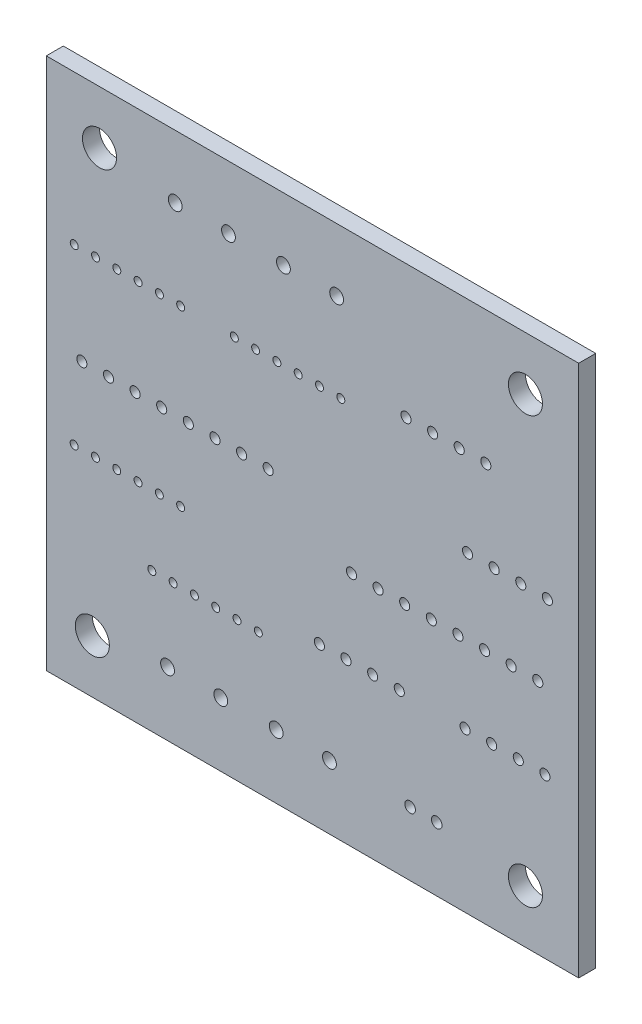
ISO-10303-21;
HEADER;
FILE_DESCRIPTION(('STEP AP214'),'2;1');
FILE_NAME('part.step','',(''),(''),'','','');
FILE_SCHEMA(('AUTOMOTIVE_DESIGN { 1 0 10303 214 1 1 1 1 }'));
ENDSEC;
DATA;
#1=APPLICATION_CONTEXT('core data for automotive mechanical design processes');
#2=APPLICATION_PROTOCOL_DEFINITION('international standard','automotive_design',2000,#1);
#3=PRODUCT_CONTEXT('',#1,'mechanical');
#4=PRODUCT('Part','Part','',(#3));
#5=PRODUCT_RELATED_PRODUCT_CATEGORY('part','',(#4));
#6=PRODUCT_DEFINITION_FORMATION('','',#4);
#7=PRODUCT_DEFINITION_CONTEXT('part definition',#1,'design');
#8=PRODUCT_DEFINITION('design','',#6,#7);
#9=PRODUCT_DEFINITION_SHAPE('','',#8);
#10=(LENGTH_UNIT() NAMED_UNIT(*) SI_UNIT(.MILLI.,.METRE.));
#11=(NAMED_UNIT(*) PLANE_ANGLE_UNIT() SI_UNIT($,.RADIAN.));
#12=(NAMED_UNIT(*) SI_UNIT($,.STERADIAN.) SOLID_ANGLE_UNIT());
#13=UNCERTAINTY_MEASURE_WITH_UNIT(LENGTH_MEASURE(1.E-05),#10,'distance_accuracy_value','');
#14=(GEOMETRIC_REPRESENTATION_CONTEXT(3) GLOBAL_UNCERTAINTY_ASSIGNED_CONTEXT((#13)) GLOBAL_UNIT_ASSIGNED_CONTEXT((#10,
#11,#12)) REPRESENTATION_CONTEXT('',''));
#15=CARTESIAN_POINT('',(0.,0.,0.));
#16=DIRECTION('',(0.,0.,1.));
#17=DIRECTION('',(1.,0.,0.));
#18=AXIS2_PLACEMENT_3D('',#15,#16,#17);
#19=CARTESIAN_POINT('',(45.,-25.,-0.01));
#20=DIRECTION('',(0.,0.,1.));
#21=DIRECTION('',(1.,0.,0.));
#22=AXIS2_PLACEMENT_3D('',#19,#20,#21);
#23=CYLINDRICAL_SURFACE('',#22,1.6);
#24=DIRECTION('',(0.,0.,1.));
#25=VECTOR('',#24,1.);
#26=CARTESIAN_POINT('',(46.6,-25.,-0.01));
#27=LINE('',#26,#25);
#28=CARTESIAN_POINT('',(46.6,-25.,0.));
#29=VERTEX_POINT('',#28);
#30=CARTESIAN_POINT('',(46.6,-25.,1.6));
#31=VERTEX_POINT('',#30);
#32=EDGE_CURVE('E10',#29,#31,#27,.T.);
#33=ORIENTED_EDGE('',*,*,#32,.F.);
#34=CARTESIAN_POINT('',(45.,-25.,0.));
#35=DIRECTION('',(0.,0.,1.));
#36=DIRECTION('',(1.,0.,0.));
#37=AXIS2_PLACEMENT_3D('',#34,#35,#36);
#38=CIRCLE('',#37,1.6);
#39=EDGE_CURVE('E1142',#29,#29,#38,.T.);
#40=ORIENTED_EDGE('',*,*,#39,.F.);
#41=ORIENTED_EDGE('',*,*,#32,.T.);
#42=CARTESIAN_POINT('',(45.,-25.,1.6));
#43=DIRECTION('',(0.,0.,1.));
#44=DIRECTION('',(1.,0.,0.));
#45=AXIS2_PLACEMENT_3D('',#42,#43,#44);
#46=CIRCLE('',#45,1.6);
#47=EDGE_CURVE('E723',#31,#31,#46,.T.);
#48=ORIENTED_EDGE('',*,*,#47,.T.);
#49=EDGE_LOOP('',(#33,#40,#41,#48));
#50=FACE_BOUND('',#49,.T.);
#51=ADVANCED_FACE('F15',(#50),#23,.F.);
#52=CARTESIAN_POINT('',(52.11,-25.9,-0.01));
#53=DIRECTION('',(0.,0.,1.));
#54=DIRECTION('',(1.,0.,0.));
#55=AXIS2_PLACEMENT_3D('',#52,#53,#54);
#56=CYLINDRICAL_SURFACE('',#55,0.65);
#57=DIRECTION('',(0.,0.,1.));
#58=VECTOR('',#57,1.);
#59=CARTESIAN_POINT('',(52.76,-25.9,-0.01));
#60=LINE('',#59,#58);
#61=CARTESIAN_POINT('',(52.76,-25.9,0.));
#62=VERTEX_POINT('',#61);
#63=CARTESIAN_POINT('',(52.76,-25.9,1.6));
#64=VERTEX_POINT('',#63);
#65=EDGE_CURVE('E26',#62,#64,#60,.T.);
#66=ORIENTED_EDGE('',*,*,#65,.F.);
#67=CARTESIAN_POINT('',(52.11,-25.9,0.));
#68=DIRECTION('',(0.,0.,1.));
#69=DIRECTION('',(1.,0.,0.));
#70=AXIS2_PLACEMENT_3D('',#67,#68,#69);
#71=CIRCLE('',#70,0.65);
#72=EDGE_CURVE('E1060',#62,#62,#71,.T.);
#73=ORIENTED_EDGE('',*,*,#72,.F.);
#74=ORIENTED_EDGE('',*,*,#65,.T.);
#75=CARTESIAN_POINT('',(52.11,-25.9,1.6));
#76=DIRECTION('',(0.,0.,1.));
#77=DIRECTION('',(1.,0.,0.));
#78=AXIS2_PLACEMENT_3D('',#75,#76,#77);
#79=CIRCLE('',#78,0.65);
#80=EDGE_CURVE('E727',#64,#64,#79,.T.);
#81=ORIENTED_EDGE('',*,*,#80,.T.);
#82=EDGE_LOOP('',(#66,#73,#74,#81));
#83=FACE_BOUND('',#82,.T.);
#84=ADVANCED_FACE('F1588',(#83),#56,.F.);
#85=CARTESIAN_POINT('',(42.625,-34.036,-0.01));
#86=DIRECTION('',(0.,0.,1.));
#87=DIRECTION('',(1.,0.,0.));
#88=AXIS2_PLACEMENT_3D('',#85,#86,#87);
#89=CYLINDRICAL_SURFACE('',#88,0.375);
#90=DIRECTION('',(0.,0.,1.));
#91=VECTOR('',#90,1.);
#92=CARTESIAN_POINT('',(43.,-34.036,-0.01));
#93=LINE('',#92,#91);
#94=CARTESIAN_POINT('',(43.,-34.036,0.));
#95=VERTEX_POINT('',#94);
#96=CARTESIAN_POINT('',(43.,-34.036,1.6));
#97=VERTEX_POINT('',#96);
#98=EDGE_CURVE('E1089',#95,#97,#93,.T.);
#99=ORIENTED_EDGE('',*,*,#98,.F.);
#100=CARTESIAN_POINT('',(42.625,-34.036,0.));
#101=DIRECTION('',(0.,0.,1.));
#102=DIRECTION('',(1.,0.,0.));
#103=AXIS2_PLACEMENT_3D('',#100,#101,#102);
#104=CIRCLE('',#103,0.375);
#105=EDGE_CURVE('E1056',#95,#95,#104,.T.);
#106=ORIENTED_EDGE('',*,*,#105,.F.);
#107=ORIENTED_EDGE('',*,*,#98,.T.);
#108=CARTESIAN_POINT('',(42.625,-34.036,1.6));
#109=DIRECTION('',(0.,0.,1.));
#110=DIRECTION('',(1.,0.,0.));
#111=AXIS2_PLACEMENT_3D('',#108,#109,#110);
#112=CIRCLE('',#111,0.375);
#113=EDGE_CURVE('E1072',#97,#97,#112,.T.);
#114=ORIENTED_EDGE('',*,*,#113,.T.);
#115=EDGE_LOOP('',(#99,#106,#107,#114));
#116=FACE_BOUND('',#115,.T.);
#117=ADVANCED_FACE('F1593',(#116),#89,.F.);
#118=CARTESIAN_POINT('',(44.625,-34.036,-0.01));
#119=DIRECTION('',(0.,0.,1.));
#120=DIRECTION('',(1.,0.,0.));
#121=AXIS2_PLACEMENT_3D('',#118,#119,#120);
#122=CYLINDRICAL_SURFACE('',#121,0.375);
#123=DIRECTION('',(0.,0.,1.));
#124=VECTOR('',#123,1.);
#125=CARTESIAN_POINT('',(45.,-34.036,-0.01));
#126=LINE('',#125,#124);
#127=CARTESIAN_POINT('',(45.,-34.036,0.));
#128=VERTEX_POINT('',#127);
#129=CARTESIAN_POINT('',(45.,-34.036,1.6));
#130=VERTEX_POINT('',#129);
#131=EDGE_CURVE('E844',#128,#130,#126,.T.);
#132=ORIENTED_EDGE('',*,*,#131,.F.);
#133=CARTESIAN_POINT('',(44.625,-34.036,0.));
#134=DIRECTION('',(0.,0.,1.));
#135=DIRECTION('',(1.,0.,0.));
#136=AXIS2_PLACEMENT_3D('',#133,#134,#135);
#137=CIRCLE('',#136,0.375);
#138=EDGE_CURVE('E1061',#128,#128,#137,.T.);
#139=ORIENTED_EDGE('',*,*,#138,.F.);
#140=ORIENTED_EDGE('',*,*,#131,.T.);
#141=CARTESIAN_POINT('',(44.625,-34.036,1.6));
#142=DIRECTION('',(0.,0.,1.));
#143=DIRECTION('',(1.,0.,0.));
#144=AXIS2_PLACEMENT_3D('',#141,#142,#143);
#145=CIRCLE('',#144,0.375);
#146=EDGE_CURVE('E1032',#130,#130,#145,.T.);
#147=ORIENTED_EDGE('',*,*,#146,.T.);
#148=EDGE_LOOP('',(#132,#139,#140,#147));
#149=FACE_BOUND('',#148,.T.);
#150=ADVANCED_FACE('F1665',(#149),#122,.F.);
#151=CARTESIAN_POINT('',(46.625,-34.036,-0.01));
#152=DIRECTION('',(0.,0.,1.));
#153=DIRECTION('',(1.,0.,0.));
#154=AXIS2_PLACEMENT_3D('',#151,#152,#153);
#155=CYLINDRICAL_SURFACE('',#154,0.375);
#156=DIRECTION('',(0.,0.,1.));
#157=VECTOR('',#156,1.);
#158=CARTESIAN_POINT('',(47.,-34.036,-0.01));
#159=LINE('',#158,#157);
#160=CARTESIAN_POINT('',(47.,-34.036,0.));
#161=VERTEX_POINT('',#160);
#162=CARTESIAN_POINT('',(47.,-34.036,1.6));
#163=VERTEX_POINT('',#162);
#164=EDGE_CURVE('E841',#161,#163,#159,.T.);
#165=ORIENTED_EDGE('',*,*,#164,.F.);
#166=CARTESIAN_POINT('',(46.625,-34.036,0.));
#167=DIRECTION('',(0.,0.,1.));
#168=DIRECTION('',(1.,0.,0.));
#169=AXIS2_PLACEMENT_3D('',#166,#167,#168);
#170=CIRCLE('',#169,0.375);
#171=EDGE_CURVE('E809',#161,#161,#170,.T.);
#172=ORIENTED_EDGE('',*,*,#171,.F.);
#173=ORIENTED_EDGE('',*,*,#164,.T.);
#174=CARTESIAN_POINT('',(46.625,-34.036,1.6));
#175=DIRECTION('',(0.,0.,1.));
#176=DIRECTION('',(1.,0.,0.));
#177=AXIS2_PLACEMENT_3D('',#174,#175,#176);
#178=CIRCLE('',#177,0.375);
#179=EDGE_CURVE('E1028',#163,#163,#178,.T.);
#180=ORIENTED_EDGE('',*,*,#179,.T.);
#181=EDGE_LOOP('',(#165,#172,#173,#180));
#182=FACE_BOUND('',#181,.T.);
#183=ADVANCED_FACE('F1670',(#182),#155,.F.);
#184=CARTESIAN_POINT('',(48.625,-34.036,-0.01));
#185=DIRECTION('',(0.,0.,1.));
#186=DIRECTION('',(1.,0.,0.));
#187=AXIS2_PLACEMENT_3D('',#184,#185,#186);
#188=CYLINDRICAL_SURFACE('',#187,0.375);
#189=DIRECTION('',(0.,0.,1.));
#190=VECTOR('',#189,1.);
#191=CARTESIAN_POINT('',(49.,-34.036,-0.01));
#192=LINE('',#191,#190);
#193=CARTESIAN_POINT('',(49.,-34.036,0.));
#194=VERTEX_POINT('',#193);
#195=CARTESIAN_POINT('',(49.,-34.036,1.6));
#196=VERTEX_POINT('',#195);
#197=EDGE_CURVE('E845',#194,#196,#192,.T.);
#198=ORIENTED_EDGE('',*,*,#197,.F.);
#199=CARTESIAN_POINT('',(48.625,-34.036,0.));
#200=DIRECTION('',(0.,0.,1.));
#201=DIRECTION('',(1.,0.,0.));
#202=AXIS2_PLACEMENT_3D('',#199,#200,#201);
#203=CIRCLE('',#202,0.375);
#204=EDGE_CURVE('E805',#194,#194,#203,.T.);
#205=ORIENTED_EDGE('',*,*,#204,.F.);
#206=ORIENTED_EDGE('',*,*,#197,.T.);
#207=CARTESIAN_POINT('',(48.625,-34.036,1.6));
#208=DIRECTION('',(0.,0.,1.));
#209=DIRECTION('',(1.,0.,0.));
#210=AXIS2_PLACEMENT_3D('',#207,#208,#209);
#211=CIRCLE('',#210,0.375);
#212=EDGE_CURVE('E924',#196,#196,#211,.T.);
#213=ORIENTED_EDGE('',*,*,#212,.T.);
#214=EDGE_LOOP('',(#198,#205,#206,#213));
#215=FACE_BOUND('',#214,.T.);
#216=ADVANCED_FACE('F1799',(#215),#188,.F.);
#217=CARTESIAN_POINT('',(50.625,-34.036,-0.01));
#218=DIRECTION('',(0.,0.,1.));
#219=DIRECTION('',(1.,0.,0.));
#220=AXIS2_PLACEMENT_3D('',#217,#218,#219);
#221=CYLINDRICAL_SURFACE('',#220,0.375);
#222=DIRECTION('',(0.,0.,1.));
#223=VECTOR('',#222,1.);
#224=CARTESIAN_POINT('',(51.,-34.036,-0.01));
#225=LINE('',#224,#223);
#226=CARTESIAN_POINT('',(51.,-34.036,0.));
#227=VERTEX_POINT('',#226);
#228=CARTESIAN_POINT('',(51.,-34.036,1.6));
#229=VERTEX_POINT('',#228);
#230=EDGE_CURVE('E947',#227,#229,#225,.T.);
#231=ORIENTED_EDGE('',*,*,#230,.F.);
#232=CARTESIAN_POINT('',(50.625,-34.036,0.));
#233=DIRECTION('',(0.,0.,1.));
#234=DIRECTION('',(1.,0.,0.));
#235=AXIS2_PLACEMENT_3D('',#232,#233,#234);
#236=CIRCLE('',#235,0.375);
#237=EDGE_CURVE('E810',#227,#227,#236,.T.);
#238=ORIENTED_EDGE('',*,*,#237,.F.);
#239=ORIENTED_EDGE('',*,*,#230,.T.);
#240=CARTESIAN_POINT('',(50.625,-34.036,1.6));
#241=DIRECTION('',(0.,0.,1.));
#242=DIRECTION('',(1.,0.,0.));
#243=AXIS2_PLACEMENT_3D('',#240,#241,#242);
#244=CIRCLE('',#243,0.375);
#245=EDGE_CURVE('E920',#229,#229,#244,.T.);
#246=ORIENTED_EDGE('',*,*,#245,.T.);
#247=EDGE_LOOP('',(#231,#238,#239,#246));
#248=FACE_BOUND('',#247,.T.);
#249=ADVANCED_FACE('F1831',(#248),#221,.F.);
#250=CARTESIAN_POINT('',(52.625,-34.036,-0.01));
#251=DIRECTION('',(0.,0.,1.));
#252=DIRECTION('',(1.,0.,0.));
#253=AXIS2_PLACEMENT_3D('',#250,#251,#252);
#254=CYLINDRICAL_SURFACE('',#253,0.375);
#255=DIRECTION('',(0.,0.,1.));
#256=VECTOR('',#255,1.);
#257=CARTESIAN_POINT('',(53.,-34.036,-0.01));
#258=LINE('',#257,#256);
#259=CARTESIAN_POINT('',(53.,-34.036,0.));
#260=VERTEX_POINT('',#259);
#261=CARTESIAN_POINT('',(53.,-34.036,1.6));
#262=VERTEX_POINT('',#261);
#263=EDGE_CURVE('E950',#260,#262,#258,.T.);
#264=ORIENTED_EDGE('',*,*,#263,.F.);
#265=CARTESIAN_POINT('',(52.625,-34.036,0.));
#266=DIRECTION('',(0.,0.,1.));
#267=DIRECTION('',(1.,0.,0.));
#268=AXIS2_PLACEMENT_3D('',#265,#266,#267);
#269=CIRCLE('',#268,0.375);
#270=EDGE_CURVE('E852',#260,#260,#269,.T.);
#271=ORIENTED_EDGE('',*,*,#270,.F.);
#272=ORIENTED_EDGE('',*,*,#263,.T.);
#273=CARTESIAN_POINT('',(52.625,-34.036,1.6));
#274=DIRECTION('',(0.,0.,1.));
#275=DIRECTION('',(1.,0.,0.));
#276=AXIS2_PLACEMENT_3D('',#273,#274,#275);
#277=CIRCLE('',#276,0.375);
#278=EDGE_CURVE('E925',#262,#262,#277,.T.);
#279=ORIENTED_EDGE('',*,*,#278,.T.);
#280=EDGE_LOOP('',(#264,#271,#272,#279));
#281=FACE_BOUND('',#280,.T.);
#282=ADVANCED_FACE('F1828',(#281),#254,.F.);
#283=CARTESIAN_POINT('',(57.11,-25.9,-0.01));
#284=DIRECTION('',(0.,0.,1.));
#285=DIRECTION('',(1.,0.,0.));
#286=AXIS2_PLACEMENT_3D('',#283,#284,#285);
#287=CYLINDRICAL_SURFACE('',#286,0.65);
#288=DIRECTION('',(0.,0.,1.));
#289=VECTOR('',#288,1.);
#290=CARTESIAN_POINT('',(57.76,-25.9,-0.01));
#291=LINE('',#290,#289);
#292=CARTESIAN_POINT('',(57.76,-25.9,0.));
#293=VERTEX_POINT('',#292);
#294=CARTESIAN_POINT('',(57.76,-25.9,1.6));
#295=VERTEX_POINT('',#294);
#296=EDGE_CURVE('E1278',#293,#295,#291,.T.);
#297=ORIENTED_EDGE('',*,*,#296,.F.);
#298=CARTESIAN_POINT('',(57.11,-25.9,0.));
#299=DIRECTION('',(0.,0.,1.));
#300=DIRECTION('',(1.,0.,0.));
#301=AXIS2_PLACEMENT_3D('',#298,#299,#300);
#302=CIRCLE('',#301,0.65);
#303=EDGE_CURVE('E856',#293,#293,#302,.T.);
#304=ORIENTED_EDGE('',*,*,#303,.F.);
#305=ORIENTED_EDGE('',*,*,#296,.T.);
#306=CARTESIAN_POINT('',(57.11,-25.9,1.6));
#307=DIRECTION('',(0.,0.,1.));
#308=DIRECTION('',(1.,0.,0.));
#309=AXIS2_PLACEMENT_3D('',#306,#307,#308);
#310=CIRCLE('',#309,0.65);
#311=EDGE_CURVE('E1124',#295,#295,#310,.T.);
#312=ORIENTED_EDGE('',*,*,#311,.T.);
#313=EDGE_LOOP('',(#297,#304,#305,#312));
#314=FACE_BOUND('',#313,.T.);
#315=ADVANCED_FACE('F1820',(#314),#287,.F.);
#316=CARTESIAN_POINT('',(62.27,-25.9,-0.01));
#317=DIRECTION('',(0.,0.,1.));
#318=DIRECTION('',(1.,0.,0.));
#319=AXIS2_PLACEMENT_3D('',#316,#317,#318);
#320=CYLINDRICAL_SURFACE('',#319,0.65);
#321=DIRECTION('',(0.,0.,1.));
#322=VECTOR('',#321,1.);
#323=CARTESIAN_POINT('',(62.92,-25.9,-0.01));
#324=LINE('',#323,#322);
#325=CARTESIAN_POINT('',(62.92,-25.9,0.));
#326=VERTEX_POINT('',#325);
#327=CARTESIAN_POINT('',(62.92,-25.9,1.6));
#328=VERTEX_POINT('',#327);
#329=EDGE_CURVE('E1328',#326,#328,#324,.T.);
#330=ORIENTED_EDGE('',*,*,#329,.F.);
#331=CARTESIAN_POINT('',(62.27,-25.9,0.));
#332=DIRECTION('',(0.,0.,1.));
#333=DIRECTION('',(1.,0.,0.));
#334=AXIS2_PLACEMENT_3D('',#331,#332,#333);
#335=CIRCLE('',#334,0.65);
#336=EDGE_CURVE('E1043',#326,#326,#335,.T.);
#337=ORIENTED_EDGE('',*,*,#336,.F.);
#338=ORIENTED_EDGE('',*,*,#329,.T.);
#339=CARTESIAN_POINT('',(62.27,-25.9,1.6));
#340=DIRECTION('',(0.,0.,1.));
#341=DIRECTION('',(1.,0.,0.));
#342=AXIS2_PLACEMENT_3D('',#339,#340,#341);
#343=CIRCLE('',#342,0.65);
#344=EDGE_CURVE('E1086',#328,#328,#343,.T.);
#345=ORIENTED_EDGE('',*,*,#344,.T.);
#346=EDGE_LOOP('',(#330,#337,#338,#345));
#347=FACE_BOUND('',#346,.T.);
#348=ADVANCED_FACE('F1439',(#347),#320,.F.);
#349=CARTESIAN_POINT('',(57.658,-34.036,-0.01));
#350=DIRECTION('',(0.,0.,1.));
#351=DIRECTION('',(1.,0.,0.));
#352=AXIS2_PLACEMENT_3D('',#349,#350,#351);
#353=CYLINDRICAL_SURFACE('',#352,0.375);
#354=DIRECTION('',(0.,0.,1.));
#355=VECTOR('',#354,1.);
#356=CARTESIAN_POINT('',(58.033,-34.036,-0.01));
#357=LINE('',#356,#355);
#358=CARTESIAN_POINT('',(58.033,-34.036,0.));
#359=VERTEX_POINT('',#358);
#360=CARTESIAN_POINT('',(58.033,-34.036,1.6));
#361=VERTEX_POINT('',#360);
#362=EDGE_CURVE('E1018',#359,#361,#357,.T.);
#363=ORIENTED_EDGE('',*,*,#362,.F.);
#364=CARTESIAN_POINT('',(57.658,-34.036,0.));
#365=DIRECTION('',(0.,0.,1.));
#366=DIRECTION('',(1.,0.,0.));
#367=AXIS2_PLACEMENT_3D('',#364,#365,#366);
#368=CIRCLE('',#367,0.375);
#369=EDGE_CURVE('E1125',#359,#359,#368,.T.);
#370=ORIENTED_EDGE('',*,*,#369,.F.);
#371=ORIENTED_EDGE('',*,*,#362,.T.);
#372=CARTESIAN_POINT('',(57.658,-34.036,1.6));
#373=DIRECTION('',(0.,0.,1.));
#374=DIRECTION('',(1.,0.,0.));
#375=AXIS2_PLACEMENT_3D('',#372,#373,#374);
#376=CIRCLE('',#375,0.375);
#377=EDGE_CURVE('E1027',#361,#361,#376,.T.);
#378=ORIENTED_EDGE('',*,*,#377,.T.);
#379=EDGE_LOOP('',(#363,#370,#371,#378));
#380=FACE_BOUND('',#379,.T.);
#381=ADVANCED_FACE('F1662',(#380),#353,.F.);
#382=CARTESIAN_POINT('',(59.658,-34.036,-0.01));
#383=DIRECTION('',(0.,0.,1.));
#384=DIRECTION('',(1.,0.,0.));
#385=AXIS2_PLACEMENT_3D('',#382,#383,#384);
#386=CYLINDRICAL_SURFACE('',#385,0.375);
#387=DIRECTION('',(0.,0.,1.));
#388=VECTOR('',#387,1.);
#389=CARTESIAN_POINT('',(60.033,-34.036,-0.01));
#390=LINE('',#389,#388);
#391=CARTESIAN_POINT('',(60.033,-34.036,0.));
#392=VERTEX_POINT('',#391);
#393=CARTESIAN_POINT('',(60.033,-34.036,1.6));
#394=VERTEX_POINT('',#393);
#395=EDGE_CURVE('E1015',#392,#394,#390,.T.);
#396=ORIENTED_EDGE('',*,*,#395,.F.);
#397=CARTESIAN_POINT('',(59.658,-34.036,0.));
#398=DIRECTION('',(0.,0.,1.));
#399=DIRECTION('',(1.,0.,0.));
#400=AXIS2_PLACEMENT_3D('',#397,#398,#399);
#401=CIRCLE('',#400,0.375);
#402=EDGE_CURVE('E850',#392,#392,#401,.T.);
#403=ORIENTED_EDGE('',*,*,#402,.F.);
#404=ORIENTED_EDGE('',*,*,#395,.T.);
#405=CARTESIAN_POINT('',(59.658,-34.036,1.6));
#406=DIRECTION('',(0.,0.,1.));
#407=DIRECTION('',(1.,0.,0.));
#408=AXIS2_PLACEMENT_3D('',#405,#406,#407);
#409=CIRCLE('',#408,0.375);
#410=EDGE_CURVE('E1023',#394,#394,#409,.T.);
#411=ORIENTED_EDGE('',*,*,#410,.T.);
#412=EDGE_LOOP('',(#396,#403,#404,#411));
#413=FACE_BOUND('',#412,.T.);
#414=ADVANCED_FACE('F1659',(#413),#386,.F.);
#415=CARTESIAN_POINT('',(61.658,-34.036,-0.01));
#416=DIRECTION('',(0.,0.,1.));
#417=DIRECTION('',(1.,0.,0.));
#418=AXIS2_PLACEMENT_3D('',#415,#416,#417);
#419=CYLINDRICAL_SURFACE('',#418,0.375);
#420=DIRECTION('',(0.,0.,1.));
#421=VECTOR('',#420,1.);
#422=CARTESIAN_POINT('',(62.033,-34.036,-0.01));
#423=LINE('',#422,#421);
#424=CARTESIAN_POINT('',(62.033,-34.036,0.));
#425=VERTEX_POINT('',#424);
#426=CARTESIAN_POINT('',(62.033,-34.036,1.6));
#427=VERTEX_POINT('',#426);
#428=EDGE_CURVE('E765',#425,#427,#423,.T.);
#429=ORIENTED_EDGE('',*,*,#428,.F.);
#430=CARTESIAN_POINT('',(61.658,-34.036,0.));
#431=DIRECTION('',(0.,0.,1.));
#432=DIRECTION('',(1.,0.,0.));
#433=AXIS2_PLACEMENT_3D('',#430,#431,#432);
#434=CIRCLE('',#433,0.375);
#435=EDGE_CURVE('E846',#425,#425,#434,.T.);
#436=ORIENTED_EDGE('',*,*,#435,.F.);
#437=ORIENTED_EDGE('',*,*,#428,.T.);
#438=CARTESIAN_POINT('',(61.658,-34.036,1.6));
#439=DIRECTION('',(0.,0.,1.));
#440=DIRECTION('',(1.,0.,0.));
#441=AXIS2_PLACEMENT_3D('',#438,#439,#440);
#442=CIRCLE('',#441,0.375);
#443=EDGE_CURVE('E722',#427,#427,#442,.T.);
#444=ORIENTED_EDGE('',*,*,#443,.T.);
#445=EDGE_LOOP('',(#429,#436,#437,#444));
#446=FACE_BOUND('',#445,.T.);
#447=ADVANCED_FACE('F1661',(#446),#419,.F.);
#448=CARTESIAN_POINT('',(63.658,-34.036,-0.01));
#449=DIRECTION('',(0.,0.,1.));
#450=DIRECTION('',(1.,0.,0.));
#451=AXIS2_PLACEMENT_3D('',#448,#449,#450);
#452=CYLINDRICAL_SURFACE('',#451,0.375);
#453=DIRECTION('',(0.,0.,1.));
#454=VECTOR('',#453,1.);
#455=CARTESIAN_POINT('',(64.033,-34.036,-0.01));
#456=LINE('',#455,#454);
#457=CARTESIAN_POINT('',(64.033,-34.036,0.));
#458=VERTEX_POINT('',#457);
#459=CARTESIAN_POINT('',(64.033,-34.036,1.6));
#460=VERTEX_POINT('',#459);
#461=EDGE_CURVE('E762',#458,#460,#456,.T.);
#462=ORIENTED_EDGE('',*,*,#461,.F.);
#463=CARTESIAN_POINT('',(63.658,-34.036,0.));
#464=DIRECTION('',(0.,0.,1.));
#465=DIRECTION('',(1.,0.,0.));
#466=AXIS2_PLACEMENT_3D('',#463,#464,#465);
#467=CIRCLE('',#466,0.375);
#468=EDGE_CURVE('E851',#458,#458,#467,.T.);
#469=ORIENTED_EDGE('',*,*,#468,.F.);
#470=ORIENTED_EDGE('',*,*,#461,.T.);
#471=CARTESIAN_POINT('',(63.658,-34.036,1.6));
#472=DIRECTION('',(0.,0.,1.));
#473=DIRECTION('',(1.,0.,0.));
#474=AXIS2_PLACEMENT_3D('',#471,#472,#473);
#475=CIRCLE('',#474,0.375);
#476=EDGE_CURVE('E718',#460,#460,#475,.T.);
#477=ORIENTED_EDGE('',*,*,#476,.T.);
#478=EDGE_LOOP('',(#462,#469,#470,#477));
#479=FACE_BOUND('',#478,.T.);
#480=ADVANCED_FACE('F1822',(#479),#452,.F.);
#481=CARTESIAN_POINT('',(43.34,-43.18,-0.01));
#482=DIRECTION('',(0.,0.,1.));
#483=DIRECTION('',(1.,0.,0.));
#484=AXIS2_PLACEMENT_3D('',#481,#482,#483);
#485=CYLINDRICAL_SURFACE('',#484,0.475);
#486=DIRECTION('',(0.,0.,1.));
#487=VECTOR('',#486,1.);
#488=CARTESIAN_POINT('',(43.815,-43.18,-0.01));
#489=LINE('',#488,#487);
#490=CARTESIAN_POINT('',(43.815,-43.18,0.));
#491=VERTEX_POINT('',#490);
#492=CARTESIAN_POINT('',(43.815,-43.18,1.6));
#493=VERTEX_POINT('',#492);
#494=EDGE_CURVE('E716',#491,#493,#489,.T.);
#495=ORIENTED_EDGE('',*,*,#494,.F.);
#496=CARTESIAN_POINT('',(43.34,-43.18,0.));
#497=DIRECTION('',(0.,0.,1.));
#498=DIRECTION('',(1.,0.,0.));
#499=AXIS2_PLACEMENT_3D('',#496,#497,#498);
#500=CIRCLE('',#499,0.475);
#501=EDGE_CURVE('E1146',#491,#491,#500,.T.);
#502=ORIENTED_EDGE('',*,*,#501,.F.);
#503=ORIENTED_EDGE('',*,*,#494,.T.);
#504=CARTESIAN_POINT('',(43.34,-43.18,1.6));
#505=DIRECTION('',(0.,0.,1.));
#506=DIRECTION('',(1.,0.,0.));
#507=AXIS2_PLACEMENT_3D('',#504,#505,#506);
#508=CIRCLE('',#507,0.475);
#509=EDGE_CURVE('E692',#493,#493,#508,.T.);
#510=ORIENTED_EDGE('',*,*,#509,.T.);
#511=EDGE_LOOP('',(#495,#502,#503,#510));
#512=FACE_BOUND('',#511,.T.);
#513=ADVANCED_FACE('F1610',(#512),#485,.F.);
#514=CARTESIAN_POINT('',(45.84,-43.18,-0.01));
#515=DIRECTION('',(0.,0.,1.));
#516=DIRECTION('',(1.,0.,0.));
#517=AXIS2_PLACEMENT_3D('',#514,#515,#516);
#518=CYLINDRICAL_SURFACE('',#517,0.475);
#519=DIRECTION('',(0.,0.,1.));
#520=VECTOR('',#519,1.);
#521=CARTESIAN_POINT('',(46.315,-43.18,-0.01));
#522=LINE('',#521,#520);
#523=CARTESIAN_POINT('',(46.315,-43.18,0.));
#524=VERTEX_POINT('',#523);
#525=CARTESIAN_POINT('',(46.315,-43.18,1.6));
#526=VERTEX_POINT('',#525);
#527=EDGE_CURVE('E712',#524,#526,#522,.T.);
#528=ORIENTED_EDGE('',*,*,#527,.F.);
#529=CARTESIAN_POINT('',(45.84,-43.18,0.));
#530=DIRECTION('',(0.,0.,1.));
#531=DIRECTION('',(1.,0.,0.));
#532=AXIS2_PLACEMENT_3D('',#529,#530,#531);
#533=CIRCLE('',#532,0.475);
#534=EDGE_CURVE('E775',#524,#524,#533,.T.);
#535=ORIENTED_EDGE('',*,*,#534,.F.);
#536=ORIENTED_EDGE('',*,*,#527,.T.);
#537=CARTESIAN_POINT('',(45.84,-43.18,1.6));
#538=DIRECTION('',(0.,0.,1.));
#539=DIRECTION('',(1.,0.,0.));
#540=AXIS2_PLACEMENT_3D('',#537,#538,#539);
#541=CIRCLE('',#540,0.475);
#542=EDGE_CURVE('E688',#526,#526,#541,.T.);
#543=ORIENTED_EDGE('',*,*,#542,.T.);
#544=EDGE_LOOP('',(#528,#535,#536,#543));
#545=FACE_BOUND('',#544,.T.);
#546=ADVANCED_FACE('F1606',(#545),#518,.F.);
#547=CARTESIAN_POINT('',(48.34,-43.18,-0.01));
#548=DIRECTION('',(0.,0.,1.));
#549=DIRECTION('',(1.,0.,0.));
#550=AXIS2_PLACEMENT_3D('',#547,#548,#549);
#551=CYLINDRICAL_SURFACE('',#550,0.475);
#552=DIRECTION('',(0.,0.,1.));
#553=VECTOR('',#552,1.);
#554=CARTESIAN_POINT('',(48.815,-43.18,-0.01));
#555=LINE('',#554,#553);
#556=CARTESIAN_POINT('',(48.815,-43.18,0.));
#557=VERTEX_POINT('',#556);
#558=CARTESIAN_POINT('',(48.815,-43.18,1.6));
#559=VERTEX_POINT('',#558);
#560=EDGE_CURVE('E717',#557,#559,#555,.T.);
#561=ORIENTED_EDGE('',*,*,#560,.F.);
#562=CARTESIAN_POINT('',(48.34,-43.18,0.));
#563=DIRECTION('',(0.,0.,1.));
#564=DIRECTION('',(1.,0.,0.));
#565=AXIS2_PLACEMENT_3D('',#562,#563,#564);
#566=CIRCLE('',#565,0.475);
#567=EDGE_CURVE('E770',#557,#557,#566,.T.);
#568=ORIENTED_EDGE('',*,*,#567,.F.);
#569=ORIENTED_EDGE('',*,*,#560,.T.);
#570=CARTESIAN_POINT('',(48.34,-43.18,1.6));
#571=DIRECTION('',(0.,0.,1.));
#572=DIRECTION('',(1.,0.,0.));
#573=AXIS2_PLACEMENT_3D('',#570,#571,#572);
#574=CIRCLE('',#573,0.475);
#575=EDGE_CURVE('E693',#559,#559,#574,.T.);
#576=ORIENTED_EDGE('',*,*,#575,.T.);
#577=EDGE_LOOP('',(#561,#568,#569,#576));
#578=FACE_BOUND('',#577,.T.);
#579=ADVANCED_FACE('F1609',(#578),#551,.F.);
#580=CARTESIAN_POINT('',(50.84,-43.18,-0.01));
#581=DIRECTION('',(0.,0.,1.));
#582=DIRECTION('',(1.,0.,0.));
#583=AXIS2_PLACEMENT_3D('',#580,#581,#582);
#584=CYLINDRICAL_SURFACE('',#583,0.475);
#585=DIRECTION('',(0.,0.,1.));
#586=VECTOR('',#585,1.);
#587=CARTESIAN_POINT('',(51.315,-43.18,-0.01));
#588=LINE('',#587,#586);
#589=CARTESIAN_POINT('',(51.315,-43.18,0.));
#590=VERTEX_POINT('',#589);
#591=CARTESIAN_POINT('',(51.315,-43.18,1.6));
#592=VERTEX_POINT('',#591);
#593=EDGE_CURVE('E1044',#590,#592,#588,.T.);
#594=ORIENTED_EDGE('',*,*,#593,.F.);
#595=CARTESIAN_POINT('',(50.84,-43.18,0.));
#596=DIRECTION('',(0.,0.,1.));
#597=DIRECTION('',(1.,0.,0.));
#598=AXIS2_PLACEMENT_3D('',#595,#596,#597);
#599=CIRCLE('',#598,0.475);
#600=EDGE_CURVE('E766',#590,#590,#599,.T.);
#601=ORIENTED_EDGE('',*,*,#600,.F.);
#602=ORIENTED_EDGE('',*,*,#593,.T.);
#603=CARTESIAN_POINT('',(50.84,-43.18,1.6));
#604=DIRECTION('',(0.,0.,1.));
#605=DIRECTION('',(1.,0.,0.));
#606=AXIS2_PLACEMENT_3D('',#603,#604,#605);
#607=CIRCLE('',#606,0.475);
#608=EDGE_CURVE('E752',#592,#592,#607,.T.);
#609=ORIENTED_EDGE('',*,*,#608,.T.);
#610=EDGE_LOOP('',(#594,#601,#602,#609));
#611=FACE_BOUND('',#610,.T.);
#612=ADVANCED_FACE('F1616',(#611),#584,.F.);
#613=CARTESIAN_POINT('',(53.34,-43.18,-0.01));
#614=DIRECTION('',(0.,0.,1.));
#615=DIRECTION('',(1.,0.,0.));
#616=AXIS2_PLACEMENT_3D('',#613,#614,#615);
#617=CYLINDRICAL_SURFACE('',#616,0.475);
#618=DIRECTION('',(0.,0.,1.));
#619=VECTOR('',#618,1.);
#620=CARTESIAN_POINT('',(53.815,-43.18,-0.01));
#621=LINE('',#620,#619);
#622=CARTESIAN_POINT('',(53.815,-43.18,0.));
#623=VERTEX_POINT('',#622);
#624=CARTESIAN_POINT('',(53.815,-43.18,1.6));
#625=VERTEX_POINT('',#624);
#626=EDGE_CURVE('E1047',#623,#625,#621,.T.);
#627=ORIENTED_EDGE('',*,*,#626,.F.);
#628=CARTESIAN_POINT('',(53.34,-43.18,0.));
#629=DIRECTION('',(0.,0.,1.));
#630=DIRECTION('',(1.,0.,0.));
#631=AXIS2_PLACEMENT_3D('',#628,#629,#630);
#632=CIRCLE('',#631,0.475);
#633=EDGE_CURVE('E771',#623,#623,#632,.T.);
#634=ORIENTED_EDGE('',*,*,#633,.F.);
#635=ORIENTED_EDGE('',*,*,#626,.T.);
#636=CARTESIAN_POINT('',(53.34,-43.18,1.6));
#637=DIRECTION('',(0.,0.,1.));
#638=DIRECTION('',(1.,0.,0.));
#639=AXIS2_PLACEMENT_3D('',#636,#637,#638);
#640=CIRCLE('',#639,0.475);
#641=EDGE_CURVE('E756',#625,#625,#640,.T.);
#642=ORIENTED_EDGE('',*,*,#641,.T.);
#643=EDGE_LOOP('',(#627,#634,#635,#642));
#644=FACE_BOUND('',#643,.T.);
#645=ADVANCED_FACE('F1612',(#644),#617,.F.);
#646=CARTESIAN_POINT('',(55.84,-43.18,-0.01));
#647=DIRECTION('',(0.,0.,1.));
#648=DIRECTION('',(1.,0.,0.));
#649=AXIS2_PLACEMENT_3D('',#646,#647,#648);
#650=CYLINDRICAL_SURFACE('',#649,0.475);
#651=DIRECTION('',(0.,0.,1.));
#652=VECTOR('',#651,1.);
#653=CARTESIAN_POINT('',(56.315,-43.18,-0.01));
#654=LINE('',#653,#652);
#655=CARTESIAN_POINT('',(56.315,-43.18,0.));
#656=VERTEX_POINT('',#655);
#657=CARTESIAN_POINT('',(56.315,-43.18,1.6));
#658=VERTEX_POINT('',#657);
#659=EDGE_CURVE('E1206',#656,#658,#654,.T.);
#660=ORIENTED_EDGE('',*,*,#659,.F.);
#661=CARTESIAN_POINT('',(55.84,-43.18,0.));
#662=DIRECTION('',(0.,0.,1.));
#663=DIRECTION('',(1.,0.,0.));
#664=AXIS2_PLACEMENT_3D('',#661,#662,#663);
#665=CIRCLE('',#664,0.475);
#666=EDGE_CURVE('E901',#656,#656,#665,.T.);
#667=ORIENTED_EDGE('',*,*,#666,.F.);
#668=ORIENTED_EDGE('',*,*,#659,.T.);
#669=CARTESIAN_POINT('',(55.84,-43.18,1.6));
#670=DIRECTION('',(0.,0.,1.));
#671=DIRECTION('',(1.,0.,0.));
#672=AXIS2_PLACEMENT_3D('',#669,#670,#671);
#673=CIRCLE('',#672,0.475);
#674=EDGE_CURVE('E665',#658,#658,#673,.T.);
#675=ORIENTED_EDGE('',*,*,#674,.T.);
#676=EDGE_LOOP('',(#660,#667,#668,#675));
#677=FACE_BOUND('',#676,.T.);
#678=ADVANCED_FACE('F1615',(#677),#650,.F.);
#679=CARTESIAN_POINT('',(58.34,-43.18,-0.01));
#680=DIRECTION('',(0.,0.,1.));
#681=DIRECTION('',(1.,0.,0.));
#682=AXIS2_PLACEMENT_3D('',#679,#680,#681);
#683=CYLINDRICAL_SURFACE('',#682,0.475);
#684=DIRECTION('',(0.,0.,1.));
#685=VECTOR('',#684,1.);
#686=CARTESIAN_POINT('',(58.815,-43.18,-0.01));
#687=LINE('',#686,#685);
#688=CARTESIAN_POINT('',(58.815,-43.18,0.));
#689=VERTEX_POINT('',#688);
#690=CARTESIAN_POINT('',(58.815,-43.18,1.6));
#691=VERTEX_POINT('',#690);
#692=EDGE_CURVE('E1175',#689,#691,#687,.T.);
#693=ORIENTED_EDGE('',*,*,#692,.F.);
#694=CARTESIAN_POINT('',(58.34,-43.18,0.));
#695=DIRECTION('',(0.,0.,1.));
#696=DIRECTION('',(1.,0.,0.));
#697=AXIS2_PLACEMENT_3D('',#694,#695,#696);
#698=CIRCLE('',#697,0.475);
#699=EDGE_CURVE('E905',#689,#689,#698,.T.);
#700=ORIENTED_EDGE('',*,*,#699,.F.);
#701=ORIENTED_EDGE('',*,*,#692,.T.);
#702=CARTESIAN_POINT('',(58.34,-43.18,1.6));
#703=DIRECTION('',(0.,0.,1.));
#704=DIRECTION('',(1.,0.,0.));
#705=AXIS2_PLACEMENT_3D('',#702,#703,#704);
#706=CIRCLE('',#705,0.475);
#707=EDGE_CURVE('E662',#691,#691,#706,.T.);
#708=ORIENTED_EDGE('',*,*,#707,.T.);
#709=EDGE_LOOP('',(#693,#700,#701,#708));
#710=FACE_BOUND('',#709,.T.);
#711=ADVANCED_FACE('F1795',(#710),#683,.F.);
#712=CARTESIAN_POINT('',(60.84,-43.18,-0.01));
#713=DIRECTION('',(0.,0.,1.));
#714=DIRECTION('',(1.,0.,0.));
#715=AXIS2_PLACEMENT_3D('',#712,#713,#714);
#716=CYLINDRICAL_SURFACE('',#715,0.475);
#717=DIRECTION('',(0.,0.,1.));
#718=VECTOR('',#717,1.);
#719=CARTESIAN_POINT('',(61.315,-43.18,-0.01));
#720=LINE('',#719,#718);
#721=CARTESIAN_POINT('',(61.315,-43.18,0.));
#722=VERTEX_POINT('',#721);
#723=CARTESIAN_POINT('',(61.315,-43.18,1.6));
#724=VERTEX_POINT('',#723);
#725=EDGE_CURVE('E804',#722,#724,#720,.T.);
#726=ORIENTED_EDGE('',*,*,#725,.F.);
#727=CARTESIAN_POINT('',(60.84,-43.18,0.));
#728=DIRECTION('',(0.,0.,1.));
#729=DIRECTION('',(1.,0.,0.));
#730=AXIS2_PLACEMENT_3D('',#727,#728,#729);
#731=CIRCLE('',#730,0.475);
#732=EDGE_CURVE('E1109',#722,#722,#731,.T.);
#733=ORIENTED_EDGE('',*,*,#732,.F.);
#734=ORIENTED_EDGE('',*,*,#725,.T.);
#735=CARTESIAN_POINT('',(60.84,-43.18,1.6));
#736=DIRECTION('',(0.,0.,1.));
#737=DIRECTION('',(1.,0.,0.));
#738=AXIS2_PLACEMENT_3D('',#735,#736,#737);
#739=CIRCLE('',#738,0.475);
#740=EDGE_CURVE('E666',#724,#724,#739,.T.);
#741=ORIENTED_EDGE('',*,*,#740,.T.);
#742=EDGE_LOOP('',(#726,#733,#734,#741));
#743=FACE_BOUND('',#742,.T.);
#744=ADVANCED_FACE('F1816',(#743),#716,.F.);
#745=CARTESIAN_POINT('',(67.27,-25.9,-0.01));
#746=DIRECTION('',(0.,0.,1.));
#747=DIRECTION('',(1.,0.,0.));
#748=AXIS2_PLACEMENT_3D('',#745,#746,#747);
#749=CYLINDRICAL_SURFACE('',#748,0.65);
#750=DIRECTION('',(0.,0.,1.));
#751=VECTOR('',#750,1.);
#752=CARTESIAN_POINT('',(67.92,-25.9,-0.01));
#753=LINE('',#752,#751);
#754=CARTESIAN_POINT('',(67.92,-25.9,0.));
#755=VERTEX_POINT('',#754);
#756=CARTESIAN_POINT('',(67.92,-25.9,1.6));
#757=VERTEX_POINT('',#756);
#758=EDGE_CURVE('E801',#755,#757,#753,.T.);
#759=ORIENTED_EDGE('',*,*,#758,.F.);
#760=CARTESIAN_POINT('',(67.27,-25.9,0.));
#761=DIRECTION('',(0.,0.,1.));
#762=DIRECTION('',(1.,0.,0.));
#763=AXIS2_PLACEMENT_3D('',#760,#761,#762);
#764=CIRCLE('',#763,0.65);
#765=EDGE_CURVE('E790',#755,#755,#764,.T.);
#766=ORIENTED_EDGE('',*,*,#765,.F.);
#767=ORIENTED_EDGE('',*,*,#758,.T.);
#768=CARTESIAN_POINT('',(67.27,-25.9,1.6));
#769=DIRECTION('',(0.,0.,1.));
#770=DIRECTION('',(1.,0.,0.));
#771=AXIS2_PLACEMENT_3D('',#768,#769,#770);
#772=CIRCLE('',#771,0.65);
#773=EDGE_CURVE('E750',#757,#757,#772,.T.);
#774=ORIENTED_EDGE('',*,*,#773,.T.);
#775=EDGE_LOOP('',(#759,#766,#767,#774));
#776=FACE_BOUND('',#775,.T.);
#777=ADVANCED_FACE('F1813',(#776),#749,.F.);
#778=CARTESIAN_POINT('',(65.658,-34.036,-0.01));
#779=DIRECTION('',(0.,0.,1.));
#780=DIRECTION('',(1.,0.,0.));
#781=AXIS2_PLACEMENT_3D('',#778,#779,#780);
#782=CYLINDRICAL_SURFACE('',#781,0.375);
#783=DIRECTION('',(0.,0.,1.));
#784=VECTOR('',#783,1.);
#785=CARTESIAN_POINT('',(66.033,-34.036,-0.01));
#786=LINE('',#785,#784);
#787=CARTESIAN_POINT('',(66.033,-34.036,0.));
#788=VERTEX_POINT('',#787);
#789=CARTESIAN_POINT('',(66.033,-34.036,1.6));
#790=VERTEX_POINT('',#789);
#791=EDGE_CURVE('E19',#788,#790,#786,.T.);
#792=ORIENTED_EDGE('',*,*,#791,.F.);
#793=CARTESIAN_POINT('',(65.658,-34.036,0.));
#794=DIRECTION('',(0.,0.,1.));
#795=DIRECTION('',(1.,0.,0.));
#796=AXIS2_PLACEMENT_3D('',#793,#794,#795);
#797=CIRCLE('',#796,0.375);
#798=EDGE_CURVE('E787',#788,#788,#797,.T.);
#799=ORIENTED_EDGE('',*,*,#798,.F.);
#800=ORIENTED_EDGE('',*,*,#791,.T.);
#801=CARTESIAN_POINT('',(65.658,-34.036,1.6));
#802=DIRECTION('',(0.,0.,1.));
#803=DIRECTION('',(1.,0.,0.));
#804=AXIS2_PLACEMENT_3D('',#801,#802,#803);
#805=CIRCLE('',#804,0.375);
#806=EDGE_CURVE('E747',#790,#790,#805,.T.);
#807=ORIENTED_EDGE('',*,*,#806,.T.);
#808=EDGE_LOOP('',(#792,#799,#800,#807));
#809=FACE_BOUND('',#808,.T.);
#810=ADVANCED_FACE('F1625',(#809),#782,.F.);
#811=CARTESIAN_POINT('',(67.658,-34.036,-0.01));
#812=DIRECTION('',(0.,0.,1.));
#813=DIRECTION('',(1.,0.,0.));
#814=AXIS2_PLACEMENT_3D('',#811,#812,#813);
#815=CYLINDRICAL_SURFACE('',#814,0.375);
#816=DIRECTION('',(0.,0.,1.));
#817=VECTOR('',#816,1.);
#818=CARTESIAN_POINT('',(68.033,-34.036,-0.01));
#819=LINE('',#818,#817);
#820=CARTESIAN_POINT('',(68.033,-34.036,0.));
#821=VERTEX_POINT('',#820);
#822=CARTESIAN_POINT('',(68.033,-34.036,1.6));
#823=VERTEX_POINT('',#822);
#824=EDGE_CURVE('E527',#821,#823,#819,.T.);
#825=ORIENTED_EDGE('',*,*,#824,.F.);
#826=CARTESIAN_POINT('',(67.658,-34.036,0.));
#827=DIRECTION('',(0.,0.,1.));
#828=DIRECTION('',(1.,0.,0.));
#829=AXIS2_PLACEMENT_3D('',#826,#827,#828);
#830=CIRCLE('',#829,0.375);
#831=EDGE_CURVE('E791',#821,#821,#830,.T.);
#832=ORIENTED_EDGE('',*,*,#831,.F.);
#833=ORIENTED_EDGE('',*,*,#824,.T.);
#834=CARTESIAN_POINT('',(67.658,-34.036,1.6));
#835=DIRECTION('',(0.,0.,1.));
#836=DIRECTION('',(1.,0.,0.));
#837=AXIS2_PLACEMENT_3D('',#834,#835,#836);
#838=CIRCLE('',#837,0.375);
#839=EDGE_CURVE('E751',#823,#823,#838,.T.);
#840=ORIENTED_EDGE('',*,*,#839,.T.);
#841=EDGE_LOOP('',(#825,#832,#833,#840));
#842=FACE_BOUND('',#841,.T.);
#843=ADVANCED_FACE('F1621',(#842),#815,.F.);
#844=CARTESIAN_POINT('',(73.78,-32.512,-0.01));
#845=DIRECTION('',(0.,0.,1.));
#846=DIRECTION('',(1.,0.,0.));
#847=AXIS2_PLACEMENT_3D('',#844,#845,#846);
#848=CYLINDRICAL_SURFACE('',#847,0.475);
#849=DIRECTION('',(0.,0.,1.));
#850=VECTOR('',#849,1.);
#851=CARTESIAN_POINT('',(74.255,-32.512,-0.01));
#852=LINE('',#851,#850);
#853=CARTESIAN_POINT('',(74.255,-32.512,0.));
#854=VERTEX_POINT('',#853);
#855=CARTESIAN_POINT('',(74.255,-32.512,1.6));
#856=VERTEX_POINT('',#855);
#857=EDGE_CURVE('E866',#854,#856,#852,.T.);
#858=ORIENTED_EDGE('',*,*,#857,.F.);
#859=CARTESIAN_POINT('',(73.78,-32.512,0.));
#860=DIRECTION('',(0.,0.,1.));
#861=DIRECTION('',(1.,0.,0.));
#862=AXIS2_PLACEMENT_3D('',#859,#860,#861);
#863=CIRCLE('',#862,0.475);
#864=EDGE_CURVE('E1010',#854,#854,#863,.T.);
#865=ORIENTED_EDGE('',*,*,#864,.F.);
#866=ORIENTED_EDGE('',*,*,#857,.T.);
#867=CARTESIAN_POINT('',(73.78,-32.512,1.6));
#868=DIRECTION('',(0.,0.,1.));
#869=DIRECTION('',(1.,0.,0.));
#870=AXIS2_PLACEMENT_3D('',#867,#868,#869);
#871=CIRCLE('',#870,0.475);
#872=EDGE_CURVE('E881',#856,#856,#871,.T.);
#873=ORIENTED_EDGE('',*,*,#872,.T.);
#874=EDGE_LOOP('',(#858,#865,#866,#873));
#875=FACE_BOUND('',#874,.T.);
#876=ADVANCED_FACE('F1624',(#875),#848,.F.);
#877=CARTESIAN_POINT('',(85.,-25.,-0.01));
#878=DIRECTION('',(0.,0.,1.));
#879=DIRECTION('',(1.,0.,0.));
#880=AXIS2_PLACEMENT_3D('',#877,#878,#879);
#881=CYLINDRICAL_SURFACE('',#880,1.6);
#882=DIRECTION('',(0.,0.,1.));
#883=VECTOR('',#882,1.);
#884=CARTESIAN_POINT('',(86.6,-25.,-0.01));
#885=LINE('',#884,#883);
#886=CARTESIAN_POINT('',(86.6,-25.,0.));
#887=VERTEX_POINT('',#886);
#888=CARTESIAN_POINT('',(86.6,-25.,1.6));
#889=VERTEX_POINT('',#888);
#890=EDGE_CURVE('E1019',#887,#889,#885,.T.);
#891=ORIENTED_EDGE('',*,*,#890,.F.);
#892=CARTESIAN_POINT('',(85.,-25.,0.));
#893=DIRECTION('',(0.,0.,1.));
#894=DIRECTION('',(1.,0.,0.));
#895=AXIS2_PLACEMENT_3D('',#892,#893,#894);
#896=CIRCLE('',#895,1.6);
#897=EDGE_CURVE('E1014',#887,#887,#896,.T.);
#898=ORIENTED_EDGE('',*,*,#897,.F.);
#899=ORIENTED_EDGE('',*,*,#890,.T.);
#900=CARTESIAN_POINT('',(85.,-25.,1.6));
#901=DIRECTION('',(0.,0.,1.));
#902=DIRECTION('',(1.,0.,0.));
#903=AXIS2_PLACEMENT_3D('',#900,#901,#902);
#904=CIRCLE('',#903,1.6);
#905=EDGE_CURVE('E885',#889,#889,#904,.T.);
#906=ORIENTED_EDGE('',*,*,#905,.T.);
#907=EDGE_LOOP('',(#891,#898,#899,#906));
#908=FACE_BOUND('',#907,.T.);
#909=ADVANCED_FACE('F1886',(#908),#881,.F.);
#910=CARTESIAN_POINT('',(76.28,-32.512,-0.01));
#911=DIRECTION('',(0.,0.,1.));
#912=DIRECTION('',(1.,0.,0.));
#913=AXIS2_PLACEMENT_3D('',#910,#911,#912);
#914=CYLINDRICAL_SURFACE('',#913,0.475);
#915=DIRECTION('',(0.,0.,1.));
#916=VECTOR('',#915,1.);
#917=CARTESIAN_POINT('',(76.755,-32.512,-0.01));
#918=LINE('',#917,#916);
#919=CARTESIAN_POINT('',(76.755,-32.512,0.));
#920=VERTEX_POINT('',#919);
#921=CARTESIAN_POINT('',(76.755,-32.512,1.6));
#922=VERTEX_POINT('',#921);
#923=EDGE_CURVE('E1021',#920,#922,#918,.T.);
#924=ORIENTED_EDGE('',*,*,#923,.F.);
#925=CARTESIAN_POINT('',(76.28,-32.512,0.));
#926=DIRECTION('',(0.,0.,1.));
#927=DIRECTION('',(1.,0.,0.));
#928=AXIS2_PLACEMENT_3D('',#925,#926,#927);
#929=CIRCLE('',#928,0.475);
#930=EDGE_CURVE('E1105',#920,#920,#929,.T.);
#931=ORIENTED_EDGE('',*,*,#930,.F.);
#932=ORIENTED_EDGE('',*,*,#923,.T.);
#933=CARTESIAN_POINT('',(76.28,-32.512,1.6));
#934=DIRECTION('',(0.,0.,1.));
#935=DIRECTION('',(1.,0.,0.));
#936=AXIS2_PLACEMENT_3D('',#933,#934,#935);
#937=CIRCLE('',#936,0.475);
#938=EDGE_CURVE('E1082',#922,#922,#937,.T.);
#939=ORIENTED_EDGE('',*,*,#938,.T.);
#940=EDGE_LOOP('',(#924,#931,#932,#939));
#941=FACE_BOUND('',#940,.T.);
#942=ADVANCED_FACE('F1888',(#941),#914,.F.);
#943=CARTESIAN_POINT('',(78.78,-32.512,-0.01));
#944=DIRECTION('',(0.,0.,1.));
#945=DIRECTION('',(1.,0.,0.));
#946=AXIS2_PLACEMENT_3D('',#943,#944,#945);
#947=CYLINDRICAL_SURFACE('',#946,0.475);
#948=DIRECTION('',(0.,0.,1.));
#949=VECTOR('',#948,1.);
#950=CARTESIAN_POINT('',(79.255,-32.512,-0.01));
#951=LINE('',#950,#949);
#952=CARTESIAN_POINT('',(79.255,-32.512,0.));
#953=VERTEX_POINT('',#952);
#954=CARTESIAN_POINT('',(79.255,-32.512,1.6));
#955=VERTEX_POINT('',#954);
#956=EDGE_CURVE('E1191',#953,#955,#951,.T.);
#957=ORIENTED_EDGE('',*,*,#956,.F.);
#958=CARTESIAN_POINT('',(78.78,-32.512,0.));
#959=DIRECTION('',(0.,0.,1.));
#960=DIRECTION('',(1.,0.,0.));
#961=AXIS2_PLACEMENT_3D('',#958,#959,#960);
#962=CIRCLE('',#961,0.475);
#963=EDGE_CURVE('E954',#953,#953,#962,.T.);
#964=ORIENTED_EDGE('',*,*,#963,.F.);
#965=ORIENTED_EDGE('',*,*,#956,.T.);
#966=CARTESIAN_POINT('',(78.78,-32.512,1.6));
#967=DIRECTION('',(0.,0.,1.));
#968=DIRECTION('',(1.,0.,0.));
#969=AXIS2_PLACEMENT_3D('',#966,#967,#968);
#970=CIRCLE('',#969,0.475);
#971=EDGE_CURVE('E821',#955,#955,#970,.T.);
#972=ORIENTED_EDGE('',*,*,#971,.T.);
#973=EDGE_LOOP('',(#957,#964,#965,#972));
#974=FACE_BOUND('',#973,.T.);
#975=ADVANCED_FACE('F1893',(#974),#947,.F.);
#976=CARTESIAN_POINT('',(81.28,-32.512,-0.01));
#977=DIRECTION('',(0.,0.,1.));
#978=DIRECTION('',(1.,0.,0.));
#979=AXIS2_PLACEMENT_3D('',#976,#977,#978);
#980=CYLINDRICAL_SURFACE('',#979,0.475);
#981=DIRECTION('',(0.,0.,1.));
#982=VECTOR('',#981,1.);
#983=CARTESIAN_POINT('',(81.755,-32.512,-0.01));
#984=LINE('',#983,#982);
#985=CARTESIAN_POINT('',(81.755,-32.512,0.));
#986=VERTEX_POINT('',#985);
#987=CARTESIAN_POINT('',(81.755,-32.512,1.6));
#988=VERTEX_POINT('',#987);
#989=EDGE_CURVE('E1233',#986,#988,#984,.T.);
#990=ORIENTED_EDGE('',*,*,#989,.F.);
#991=CARTESIAN_POINT('',(81.28,-32.512,0.));
#992=DIRECTION('',(0.,0.,1.));
#993=DIRECTION('',(1.,0.,0.));
#994=AXIS2_PLACEMENT_3D('',#991,#992,#993);
#995=CIRCLE('',#994,0.475);
#996=EDGE_CURVE('E890',#986,#986,#995,.T.);
#997=ORIENTED_EDGE('',*,*,#996,.F.);
#998=ORIENTED_EDGE('',*,*,#989,.T.);
#999=CARTESIAN_POINT('',(81.28,-32.512,1.6));
#1000=DIRECTION('',(0.,0.,1.));
#1001=DIRECTION('',(1.,0.,0.));
#1002=AXIS2_PLACEMENT_3D('',#999,#1000,#1001);
#1003=CIRCLE('',#1002,0.475);
#1004=EDGE_CURVE('E817',#988,#988,#1003,.T.);
#1005=ORIENTED_EDGE('',*,*,#1004,.T.);
#1006=EDGE_LOOP('',(#990,#997,#998,#1005));
#1007=FACE_BOUND('',#1006,.T.);
#1008=ADVANCED_FACE('F1916',(#1007),#980,.F.);
#1009=CARTESIAN_POINT('',(79.562,-40.64,-0.01));
#1010=DIRECTION('',(0.,0.,1.));
#1011=DIRECTION('',(1.,0.,0.));
#1012=AXIS2_PLACEMENT_3D('',#1009,#1010,#1011);
#1013=CYLINDRICAL_SURFACE('',#1012,0.475);
#1014=DIRECTION('',(0.,0.,1.));
#1015=VECTOR('',#1014,1.);
#1016=CARTESIAN_POINT('',(80.037,-40.64,-0.01));
#1017=LINE('',#1016,#1015);
#1018=CARTESIAN_POINT('',(80.037,-40.64,0.));
#1019=VERTEX_POINT('',#1018);
#1020=CARTESIAN_POINT('',(80.037,-40.64,1.6));
#1021=VERTEX_POINT('',#1020);
#1022=EDGE_CURVE('E1006',#1019,#1021,#1017,.T.);
#1023=ORIENTED_EDGE('',*,*,#1022,.F.);
#1024=CARTESIAN_POINT('',(79.562,-40.64,0.));
#1025=DIRECTION('',(0.,0.,1.));
#1026=DIRECTION('',(1.,0.,0.));
#1027=AXIS2_PLACEMENT_3D('',#1024,#1025,#1026);
#1028=CIRCLE('',#1027,0.475);
#1029=EDGE_CURVE('E886',#1019,#1019,#1028,.T.);
#1030=ORIENTED_EDGE('',*,*,#1029,.F.);
#1031=ORIENTED_EDGE('',*,*,#1022,.T.);
#1032=CARTESIAN_POINT('',(79.562,-40.64,1.6));
#1033=DIRECTION('',(0.,0.,1.));
#1034=DIRECTION('',(1.,0.,0.));
#1035=AXIS2_PLACEMENT_3D('',#1032,#1033,#1034);
#1036=CIRCLE('',#1035,0.475);
#1037=EDGE_CURVE('E785',#1021,#1021,#1036,.T.);
#1038=ORIENTED_EDGE('',*,*,#1037,.T.);
#1039=EDGE_LOOP('',(#1023,#1030,#1031,#1038));
#1040=FACE_BOUND('',#1039,.T.);
#1041=ADVANCED_FACE('F1920',(#1040),#1013,.F.);
#1042=CARTESIAN_POINT('',(82.062,-40.64,-0.01));
#1043=DIRECTION('',(0.,0.,1.));
#1044=DIRECTION('',(1.,0.,0.));
#1045=AXIS2_PLACEMENT_3D('',#1042,#1043,#1044);
#1046=CYLINDRICAL_SURFACE('',#1045,0.475);
#1047=DIRECTION('',(0.,0.,1.));
#1048=VECTOR('',#1047,1.);
#1049=CARTESIAN_POINT('',(82.537,-40.64,-0.01));
#1050=LINE('',#1049,#1048);
#1051=CARTESIAN_POINT('',(82.537,-40.64,0.));
#1052=VERTEX_POINT('',#1051);
#1053=CARTESIAN_POINT('',(82.537,-40.64,1.6));
#1054=VERTEX_POINT('',#1053);
#1055=EDGE_CURVE('E698',#1052,#1054,#1050,.T.);
#1056=ORIENTED_EDGE('',*,*,#1055,.F.);
#1057=CARTESIAN_POINT('',(82.062,-40.64,0.));
#1058=DIRECTION('',(0.,0.,1.));
#1059=DIRECTION('',(1.,0.,0.));
#1060=AXIS2_PLACEMENT_3D('',#1057,#1058,#1059);
#1061=CIRCLE('',#1060,0.475);
#1062=EDGE_CURVE('E891',#1052,#1052,#1061,.T.);
#1063=ORIENTED_EDGE('',*,*,#1062,.F.);
#1064=ORIENTED_EDGE('',*,*,#1055,.T.);
#1065=CARTESIAN_POINT('',(82.062,-40.64,1.6));
#1066=DIRECTION('',(0.,0.,1.));
#1067=DIRECTION('',(1.,0.,0.));
#1068=AXIS2_PLACEMENT_3D('',#1065,#1066,#1067);
#1069=CIRCLE('',#1068,0.475);
#1070=EDGE_CURVE('E781',#1054,#1054,#1069,.T.);
#1071=ORIENTED_EDGE('',*,*,#1070,.T.);
#1072=EDGE_LOOP('',(#1056,#1063,#1064,#1071));
#1073=FACE_BOUND('',#1072,.T.);
#1074=ADVANCED_FACE('F1811',(#1073),#1046,.F.);
#1075=CARTESIAN_POINT('',(84.562,-40.64,-0.01));
#1076=DIRECTION('',(0.,0.,1.));
#1077=DIRECTION('',(1.,0.,0.));
#1078=AXIS2_PLACEMENT_3D('',#1075,#1076,#1077);
#1079=CYLINDRICAL_SURFACE('',#1078,0.475);
#1080=DIRECTION('',(0.,0.,1.));
#1081=VECTOR('',#1080,1.);
#1082=CARTESIAN_POINT('',(85.037,-40.64,-0.01));
#1083=LINE('',#1082,#1081);
#1084=CARTESIAN_POINT('',(85.037,-40.64,0.));
#1085=VERTEX_POINT('',#1084);
#1086=CARTESIAN_POINT('',(85.037,-40.64,1.6));
#1087=VERTEX_POINT('',#1086);
#1088=EDGE_CURVE('E694',#1085,#1087,#1083,.T.);
#1089=ORIENTED_EDGE('',*,*,#1088,.F.);
#1090=CARTESIAN_POINT('',(84.562,-40.64,0.));
#1091=DIRECTION('',(0.,0.,1.));
#1092=DIRECTION('',(1.,0.,0.));
#1093=AXIS2_PLACEMENT_3D('',#1090,#1091,#1092);
#1094=CIRCLE('',#1093,0.475);
#1095=EDGE_CURVE('E909',#1085,#1085,#1094,.T.);
#1096=ORIENTED_EDGE('',*,*,#1095,.F.);
#1097=ORIENTED_EDGE('',*,*,#1088,.T.);
#1098=CARTESIAN_POINT('',(84.562,-40.64,1.6));
#1099=DIRECTION('',(0.,0.,1.));
#1100=DIRECTION('',(1.,0.,0.));
#1101=AXIS2_PLACEMENT_3D('',#1098,#1099,#1100);
#1102=CIRCLE('',#1101,0.475);
#1103=EDGE_CURVE('E786',#1087,#1087,#1102,.T.);
#1104=ORIENTED_EDGE('',*,*,#1103,.T.);
#1105=EDGE_LOOP('',(#1089,#1096,#1097,#1104));
#1106=FACE_BOUND('',#1105,.T.);
#1107=ADVANCED_FACE('F1807',(#1106),#1079,.F.);
#1108=CARTESIAN_POINT('',(87.062,-40.64,-0.01));
#1109=DIRECTION('',(0.,0.,1.));
#1110=DIRECTION('',(1.,0.,0.));
#1111=AXIS2_PLACEMENT_3D('',#1108,#1109,#1110);
#1112=CYLINDRICAL_SURFACE('',#1111,0.475);
#1113=DIRECTION('',(0.,0.,1.));
#1114=VECTOR('',#1113,1.);
#1115=CARTESIAN_POINT('',(87.537,-40.64,-0.01));
#1116=LINE('',#1115,#1114);
#1117=CARTESIAN_POINT('',(87.537,-40.64,0.));
#1118=VERTEX_POINT('',#1117);
#1119=CARTESIAN_POINT('',(87.537,-40.64,1.6));
#1120=VERTEX_POINT('',#1119);
#1121=EDGE_CURVE('E699',#1118,#1120,#1116,.T.);
#1122=ORIENTED_EDGE('',*,*,#1121,.F.);
#1123=CARTESIAN_POINT('',(87.062,-40.64,0.));
#1124=DIRECTION('',(0.,0.,1.));
#1125=DIRECTION('',(1.,0.,0.));
#1126=AXIS2_PLACEMENT_3D('',#1123,#1124,#1125);
#1127=CIRCLE('',#1126,0.475);
#1128=EDGE_CURVE('E915',#1118,#1118,#1127,.T.);
#1129=ORIENTED_EDGE('',*,*,#1128,.F.);
#1130=ORIENTED_EDGE('',*,*,#1121,.T.);
#1131=CARTESIAN_POINT('',(87.062,-40.64,1.6));
#1132=DIRECTION('',(0.,0.,1.));
#1133=DIRECTION('',(1.,0.,0.));
#1134=AXIS2_PLACEMENT_3D('',#1131,#1132,#1133);
#1135=CIRCLE('',#1134,0.475);
#1136=EDGE_CURVE('E826',#1120,#1120,#1135,.T.);
#1137=ORIENTED_EDGE('',*,*,#1136,.T.);
#1138=EDGE_LOOP('',(#1122,#1129,#1130,#1137));
#1139=FACE_BOUND('',#1138,.T.);
#1140=ADVANCED_FACE('F1810',(#1139),#1112,.F.);
#1141=CARTESIAN_POINT('',(42.618,-50.334,-0.01));
#1142=DIRECTION('',(0.,0.,1.));
#1143=DIRECTION('',(1.,0.,0.));
#1144=AXIS2_PLACEMENT_3D('',#1141,#1142,#1143);
#1145=CYLINDRICAL_SURFACE('',#1144,0.375);
#1146=DIRECTION('',(0.,0.,1.));
#1147=VECTOR('',#1146,1.);
#1148=CARTESIAN_POINT('',(42.993,-50.334,-0.01));
#1149=LINE('',#1148,#1147);
#1150=CARTESIAN_POINT('',(42.993,-50.334,0.));
#1151=VERTEX_POINT('',#1150);
#1152=CARTESIAN_POINT('',(42.993,-50.334,1.6));
#1153=VERTEX_POINT('',#1152);
#1154=EDGE_CURVE('E997',#1151,#1153,#1149,.T.);
#1155=ORIENTED_EDGE('',*,*,#1154,.F.);
#1156=CARTESIAN_POINT('',(42.618,-50.334,0.));
#1157=DIRECTION('',(0.,0.,1.));
#1158=DIRECTION('',(1.,0.,0.));
#1159=AXIS2_PLACEMENT_3D('',#1156,#1157,#1158);
#1160=CIRCLE('',#1159,0.375);
#1161=EDGE_CURVE('E919',#1151,#1151,#1160,.T.);
#1162=ORIENTED_EDGE('',*,*,#1161,.F.);
#1163=ORIENTED_EDGE('',*,*,#1154,.T.);
#1164=CARTESIAN_POINT('',(42.618,-50.334,1.6));
#1165=DIRECTION('',(0.,0.,1.));
#1166=DIRECTION('',(1.,0.,0.));
#1167=AXIS2_PLACEMENT_3D('',#1164,#1165,#1166);
#1168=CIRCLE('',#1167,0.375);
#1169=EDGE_CURVE('E822',#1153,#1153,#1168,.T.);
#1170=ORIENTED_EDGE('',*,*,#1169,.T.);
#1171=EDGE_LOOP('',(#1155,#1162,#1163,#1170));
#1172=FACE_BOUND('',#1171,.T.);
#1173=ADVANCED_FACE('F1597',(#1172),#1145,.F.);
#1174=CARTESIAN_POINT('',(44.618,-50.334,-0.01));
#1175=DIRECTION('',(0.,0.,1.));
#1176=DIRECTION('',(1.,0.,0.));
#1177=AXIS2_PLACEMENT_3D('',#1174,#1175,#1176);
#1178=CYLINDRICAL_SURFACE('',#1177,0.375);
#1179=DIRECTION('',(0.,0.,1.));
#1180=VECTOR('',#1179,1.);
#1181=CARTESIAN_POINT('',(44.993,-50.334,-0.01));
#1182=LINE('',#1181,#1180);
#1183=CARTESIAN_POINT('',(44.993,-50.334,0.));
#1184=VERTEX_POINT('',#1183);
#1185=CARTESIAN_POINT('',(44.993,-50.334,1.6));
#1186=VERTEX_POINT('',#1185);
#1187=EDGE_CURVE('E991',#1184,#1186,#1182,.T.);
#1188=ORIENTED_EDGE('',*,*,#1187,.F.);
#1189=CARTESIAN_POINT('',(44.618,-50.334,0.));
#1190=DIRECTION('',(0.,0.,1.));
#1191=DIRECTION('',(1.,0.,0.));
#1192=AXIS2_PLACEMENT_3D('',#1189,#1190,#1191);
#1193=CIRCLE('',#1192,0.375);
#1194=EDGE_CURVE('E682',#1184,#1184,#1193,.T.);
#1195=ORIENTED_EDGE('',*,*,#1194,.F.);
#1196=ORIENTED_EDGE('',*,*,#1187,.T.);
#1197=CARTESIAN_POINT('',(44.618,-50.334,1.6));
#1198=DIRECTION('',(0.,0.,1.));
#1199=DIRECTION('',(1.,0.,0.));
#1200=AXIS2_PLACEMENT_3D('',#1197,#1198,#1199);
#1201=CIRCLE('',#1200,0.375);
#1202=EDGE_CURVE('E827',#1186,#1186,#1201,.T.);
#1203=ORIENTED_EDGE('',*,*,#1202,.T.);
#1204=EDGE_LOOP('',(#1188,#1195,#1196,#1203));
#1205=FACE_BOUND('',#1204,.T.);
#1206=ADVANCED_FACE('F1657',(#1205),#1178,.F.);
#1207=CARTESIAN_POINT('',(46.618,-50.334,-0.01));
#1208=DIRECTION('',(0.,0.,1.));
#1209=DIRECTION('',(1.,0.,0.));
#1210=AXIS2_PLACEMENT_3D('',#1207,#1208,#1209);
#1211=CYLINDRICAL_SURFACE('',#1210,0.375);
#1212=DIRECTION('',(0.,0.,1.));
#1213=VECTOR('',#1212,1.);
#1214=CARTESIAN_POINT('',(46.993,-50.334,-0.01));
#1215=LINE('',#1214,#1213);
#1216=CARTESIAN_POINT('',(46.993,-50.334,0.));
#1217=VERTEX_POINT('',#1216);
#1218=CARTESIAN_POINT('',(46.993,-50.334,1.6));
#1219=VERTEX_POINT('',#1218);
#1220=EDGE_CURVE('E988',#1217,#1219,#1215,.T.);
#1221=ORIENTED_EDGE('',*,*,#1220,.F.);
#1222=CARTESIAN_POINT('',(46.618,-50.334,0.));
#1223=DIRECTION('',(0.,0.,1.));
#1224=DIRECTION('',(1.,0.,0.));
#1225=AXIS2_PLACEMENT_3D('',#1222,#1223,#1224);
#1226=CIRCLE('',#1225,0.375);
#1227=EDGE_CURVE('E678',#1217,#1217,#1226,.T.);
#1228=ORIENTED_EDGE('',*,*,#1227,.F.);
#1229=ORIENTED_EDGE('',*,*,#1220,.T.);
#1230=CARTESIAN_POINT('',(46.618,-50.334,1.6));
#1231=DIRECTION('',(0.,0.,1.));
#1232=DIRECTION('',(1.,0.,0.));
#1233=AXIS2_PLACEMENT_3D('',#1230,#1231,#1232);
#1234=CIRCLE('',#1233,0.375);
#1235=EDGE_CURVE('E875',#1219,#1219,#1234,.T.);
#1236=ORIENTED_EDGE('',*,*,#1235,.T.);
#1237=EDGE_LOOP('',(#1221,#1228,#1229,#1236));
#1238=FACE_BOUND('',#1237,.T.);
#1239=ADVANCED_FACE('F1653',(#1238),#1211,.F.);
#1240=CARTESIAN_POINT('',(48.618,-50.334,-0.01));
#1241=DIRECTION('',(0.,0.,1.));
#1242=DIRECTION('',(1.,0.,0.));
#1243=AXIS2_PLACEMENT_3D('',#1240,#1241,#1242);
#1244=CYLINDRICAL_SURFACE('',#1243,0.375);
#1245=DIRECTION('',(0.,0.,1.));
#1246=VECTOR('',#1245,1.);
#1247=CARTESIAN_POINT('',(48.993,-50.334,-0.01));
#1248=LINE('',#1247,#1246);
#1249=CARTESIAN_POINT('',(48.993,-50.334,0.));
#1250=VERTEX_POINT('',#1249);
#1251=CARTESIAN_POINT('',(48.993,-50.334,1.6));
#1252=VERTEX_POINT('',#1251);
#1253=EDGE_CURVE('E992',#1250,#1252,#1248,.T.);
#1254=ORIENTED_EDGE('',*,*,#1253,.F.);
#1255=CARTESIAN_POINT('',(48.618,-50.334,0.));
#1256=DIRECTION('',(0.,0.,1.));
#1257=DIRECTION('',(1.,0.,0.));
#1258=AXIS2_PLACEMENT_3D('',#1255,#1256,#1257);
#1259=CIRCLE('',#1258,0.375);
#1260=EDGE_CURVE('E683',#1250,#1250,#1259,.T.);
#1261=ORIENTED_EDGE('',*,*,#1260,.F.);
#1262=ORIENTED_EDGE('',*,*,#1253,.T.);
#1263=CARTESIAN_POINT('',(48.618,-50.334,1.6));
#1264=DIRECTION('',(0.,0.,1.));
#1265=DIRECTION('',(1.,0.,0.));
#1266=AXIS2_PLACEMENT_3D('',#1263,#1264,#1265);
#1267=CIRCLE('',#1266,0.375);
#1268=EDGE_CURVE('E979',#1252,#1252,#1267,.T.);
#1269=ORIENTED_EDGE('',*,*,#1268,.T.);
#1270=EDGE_LOOP('',(#1254,#1261,#1262,#1269));
#1271=FACE_BOUND('',#1270,.T.);
#1272=ADVANCED_FACE('F1656',(#1271),#1244,.F.);
#1273=CARTESIAN_POINT('',(50.618,-50.334,-0.01));
#1274=DIRECTION('',(0.,0.,1.));
#1275=DIRECTION('',(1.,0.,0.));
#1276=AXIS2_PLACEMENT_3D('',#1273,#1274,#1275);
#1277=CYLINDRICAL_SURFACE('',#1276,0.375);
#1278=DIRECTION('',(0.,0.,1.));
#1279=VECTOR('',#1278,1.);
#1280=CARTESIAN_POINT('',(50.993,-50.334,-0.01));
#1281=LINE('',#1280,#1279);
#1282=CARTESIAN_POINT('',(50.993,-50.334,0.));
#1283=VERTEX_POINT('',#1282);
#1284=CARTESIAN_POINT('',(50.993,-50.334,1.6));
#1285=VERTEX_POINT('',#1284);
#1286=EDGE_CURVE('E425',#1283,#1285,#1281,.T.);
#1287=ORIENTED_EDGE('',*,*,#1286,.F.);
#1288=CARTESIAN_POINT('',(50.618,-50.334,0.));
#1289=DIRECTION('',(0.,0.,1.));
#1290=DIRECTION('',(1.,0.,0.));
#1291=AXIS2_PLACEMENT_3D('',#1288,#1289,#1290);
#1292=CIRCLE('',#1291,0.375);
#1293=EDGE_CURVE('E926',#1283,#1283,#1292,.T.);
#1294=ORIENTED_EDGE('',*,*,#1293,.F.);
#1295=ORIENTED_EDGE('',*,*,#1286,.T.);
#1296=CARTESIAN_POINT('',(50.618,-50.334,1.6));
#1297=DIRECTION('',(0.,0.,1.));
#1298=DIRECTION('',(1.,0.,0.));
#1299=AXIS2_PLACEMENT_3D('',#1296,#1297,#1298);
#1300=CIRCLE('',#1299,0.375);
#1301=EDGE_CURVE('E1181',#1285,#1285,#1300,.T.);
#1302=ORIENTED_EDGE('',*,*,#1301,.T.);
#1303=EDGE_LOOP('',(#1287,#1294,#1295,#1302));
#1304=FACE_BOUND('',#1303,.T.);
#1305=ADVANCED_FACE('F1835',(#1304),#1277,.F.);
#1306=CARTESIAN_POINT('',(52.618,-50.334,-0.01));
#1307=DIRECTION('',(0.,0.,1.));
#1308=DIRECTION('',(1.,0.,0.));
#1309=AXIS2_PLACEMENT_3D('',#1306,#1307,#1308);
#1310=CYLINDRICAL_SURFACE('',#1309,0.375);
#1311=DIRECTION('',(0.,0.,1.));
#1312=VECTOR('',#1311,1.);
#1313=CARTESIAN_POINT('',(52.993,-50.334,-0.01));
#1314=LINE('',#1313,#1312);
#1315=CARTESIAN_POINT('',(52.993,-50.334,0.));
#1316=VERTEX_POINT('',#1315);
#1317=CARTESIAN_POINT('',(52.993,-50.334,1.6));
#1318=VERTEX_POINT('',#1317);
#1319=EDGE_CURVE('E439',#1316,#1318,#1314,.T.);
#1320=ORIENTED_EDGE('',*,*,#1319,.F.);
#1321=CARTESIAN_POINT('',(52.618,-50.334,0.));
#1322=DIRECTION('',(0.,0.,1.));
#1323=DIRECTION('',(1.,0.,0.));
#1324=AXIS2_PLACEMENT_3D('',#1321,#1322,#1323);
#1325=CIRCLE('',#1324,0.375);
#1326=EDGE_CURVE('E930',#1316,#1316,#1325,.T.);
#1327=ORIENTED_EDGE('',*,*,#1326,.F.);
#1328=ORIENTED_EDGE('',*,*,#1319,.T.);
#1329=CARTESIAN_POINT('',(52.618,-50.334,1.6));
#1330=DIRECTION('',(0.,0.,1.));
#1331=DIRECTION('',(1.,0.,0.));
#1332=AXIS2_PLACEMENT_3D('',#1329,#1330,#1331);
#1333=CIRCLE('',#1332,0.375);
#1334=EDGE_CURVE('E1227',#1318,#1318,#1333,.T.);
#1335=ORIENTED_EDGE('',*,*,#1334,.T.);
#1336=EDGE_LOOP('',(#1320,#1327,#1328,#1335));
#1337=FACE_BOUND('',#1336,.T.);
#1338=ADVANCED_FACE('F1940',(#1337),#1310,.F.);
#1339=CARTESIAN_POINT('',(49.912,-56.896,-0.01));
#1340=DIRECTION('',(0.,0.,1.));
#1341=DIRECTION('',(1.,0.,0.));
#1342=AXIS2_PLACEMENT_3D('',#1339,#1340,#1341);
#1343=CYLINDRICAL_SURFACE('',#1342,0.375);
#1344=DIRECTION('',(0.,0.,1.));
#1345=VECTOR('',#1344,1.);
#1346=CARTESIAN_POINT('',(50.287,-56.896,-0.01));
#1347=LINE('',#1346,#1345);
#1348=CARTESIAN_POINT('',(50.287,-56.896,0.));
#1349=VERTEX_POINT('',#1348);
#1350=CARTESIAN_POINT('',(50.287,-56.896,1.6));
#1351=VERTEX_POINT('',#1350);
#1352=EDGE_CURVE('E894',#1349,#1351,#1347,.T.);
#1353=ORIENTED_EDGE('',*,*,#1352,.F.);
#1354=CARTESIAN_POINT('',(49.912,-56.896,0.));
#1355=DIRECTION('',(0.,0.,1.));
#1356=DIRECTION('',(1.,0.,0.));
#1357=AXIS2_PLACEMENT_3D('',#1354,#1355,#1356);
#1358=CIRCLE('',#1357,0.375);
#1359=EDGE_CURVE('E1207',#1349,#1349,#1358,.T.);
#1360=ORIENTED_EDGE('',*,*,#1359,.F.);
#1361=ORIENTED_EDGE('',*,*,#1352,.T.);
#1362=CARTESIAN_POINT('',(49.912,-56.896,1.6));
#1363=DIRECTION('',(0.,0.,1.));
#1364=DIRECTION('',(1.,0.,0.));
#1365=AXIS2_PLACEMENT_3D('',#1362,#1363,#1364);
#1366=CIRCLE('',#1365,0.375);
#1367=EDGE_CURVE('E1162',#1351,#1351,#1366,.T.);
#1368=ORIENTED_EDGE('',*,*,#1367,.T.);
#1369=EDGE_LOOP('',(#1353,#1360,#1361,#1368));
#1370=FACE_BOUND('',#1369,.T.);
#1371=ADVANCED_FACE('F17',(#1370),#1343,.F.);
#1372=CARTESIAN_POINT('',(51.912,-56.896,-0.01));
#1373=DIRECTION('',(0.,0.,1.));
#1374=DIRECTION('',(1.,0.,0.));
#1375=AXIS2_PLACEMENT_3D('',#1372,#1373,#1374);
#1376=CYLINDRICAL_SURFACE('',#1375,0.375);
#1377=DIRECTION('',(0.,0.,1.));
#1378=VECTOR('',#1377,1.);
#1379=CARTESIAN_POINT('',(52.287,-56.896,-0.01));
#1380=LINE('',#1379,#1378);
#1381=CARTESIAN_POINT('',(52.287,-56.896,0.));
#1382=VERTEX_POINT('',#1381);
#1383=CARTESIAN_POINT('',(52.287,-56.896,1.6));
#1384=VERTEX_POINT('',#1383);
#1385=EDGE_CURVE('E1075',#1382,#1384,#1380,.T.);
#1386=ORIENTED_EDGE('',*,*,#1385,.F.);
#1387=CARTESIAN_POINT('',(51.912,-56.896,0.));
#1388=DIRECTION('',(0.,0.,1.));
#1389=DIRECTION('',(1.,0.,0.));
#1390=AXIS2_PLACEMENT_3D('',#1387,#1388,#1389);
#1391=CIRCLE('',#1390,0.375);
#1392=EDGE_CURVE('E1211',#1382,#1382,#1391,.T.);
#1393=ORIENTED_EDGE('',*,*,#1392,.F.);
#1394=ORIENTED_EDGE('',*,*,#1385,.T.);
#1395=CARTESIAN_POINT('',(51.912,-56.896,1.6));
#1396=DIRECTION('',(0.,0.,1.));
#1397=DIRECTION('',(1.,0.,0.));
#1398=AXIS2_PLACEMENT_3D('',#1395,#1396,#1397);
#1399=CIRCLE('',#1398,0.375);
#1400=EDGE_CURVE('E1158',#1384,#1384,#1399,.T.);
#1401=ORIENTED_EDGE('',*,*,#1400,.T.);
#1402=EDGE_LOOP('',(#1386,#1393,#1394,#1401));
#1403=FACE_BOUND('',#1402,.T.);
#1404=ADVANCED_FACE('F1651',(#1403),#1376,.F.);
#1405=CARTESIAN_POINT('',(44.323,-65.,-0.01));
#1406=DIRECTION('',(0.,0.,1.));
#1407=DIRECTION('',(1.,0.,0.));
#1408=AXIS2_PLACEMENT_3D('',#1405,#1406,#1407);
#1409=CYLINDRICAL_SURFACE('',#1408,1.6);
#1410=DIRECTION('',(0.,0.,1.));
#1411=VECTOR('',#1410,1.);
#1412=CARTESIAN_POINT('',(45.923,-65.,-0.01));
#1413=LINE('',#1412,#1411);
#1414=CARTESIAN_POINT('',(45.923,-65.,0.));
#1415=VERTEX_POINT('',#1414);
#1416=CARTESIAN_POINT('',(45.923,-65.,1.6));
#1417=VERTEX_POINT('',#1416);
#1418=EDGE_CURVE('E1118',#1415,#1417,#1413,.T.);
#1419=ORIENTED_EDGE('',*,*,#1418,.F.);
#1420=CARTESIAN_POINT('',(44.323,-65.,0.));
#1421=DIRECTION('',(0.,0.,1.));
#1422=DIRECTION('',(1.,0.,0.));
#1423=AXIS2_PLACEMENT_3D('',#1420,#1421,#1422);
#1424=CIRCLE('',#1423,1.6);
#1425=EDGE_CURVE('E996',#1415,#1415,#1424,.T.);
#1426=ORIENTED_EDGE('',*,*,#1425,.F.);
#1427=ORIENTED_EDGE('',*,*,#1418,.T.);
#1428=CARTESIAN_POINT('',(44.323,-65.,1.6));
#1429=DIRECTION('',(0.,0.,1.));
#1430=DIRECTION('',(1.,0.,0.));
#1431=AXIS2_PLACEMENT_3D('',#1428,#1429,#1430);
#1432=CIRCLE('',#1431,1.6);
#1433=EDGE_CURVE('E1163',#1417,#1417,#1432,.T.);
#1434=ORIENTED_EDGE('',*,*,#1433,.T.);
#1435=EDGE_LOOP('',(#1419,#1426,#1427,#1434));
#1436=FACE_BOUND('',#1435,.T.);
#1437=ADVANCED_FACE('F1647',(#1436),#1409,.F.);
#1438=CARTESIAN_POINT('',(51.388,-64.008,-0.01));
#1439=DIRECTION('',(0.,0.,1.));
#1440=DIRECTION('',(1.,0.,0.));
#1441=AXIS2_PLACEMENT_3D('',#1438,#1439,#1440);
#1442=CYLINDRICAL_SURFACE('',#1441,0.65);
#1443=DIRECTION('',(0.,0.,1.));
#1444=VECTOR('',#1443,1.);
#1445=CARTESIAN_POINT('',(52.038,-64.008,-0.01));
#1446=LINE('',#1445,#1444);
#1447=CARTESIAN_POINT('',(52.038,-64.008,0.));
#1448=VERTEX_POINT('',#1447);
#1449=CARTESIAN_POINT('',(52.038,-64.008,1.6));
#1450=VERTEX_POINT('',#1449);
#1451=EDGE_CURVE('E1065',#1448,#1450,#1446,.T.);
#1452=ORIENTED_EDGE('',*,*,#1451,.F.);
#1453=CARTESIAN_POINT('',(51.388,-64.008,0.));
#1454=DIRECTION('',(0.,0.,1.));
#1455=DIRECTION('',(1.,0.,0.));
#1456=AXIS2_PLACEMENT_3D('',#1453,#1454,#1455);
#1457=CIRCLE('',#1456,0.65);
#1458=EDGE_CURVE('E937',#1448,#1448,#1457,.T.);
#1459=ORIENTED_EDGE('',*,*,#1458,.F.);
#1460=ORIENTED_EDGE('',*,*,#1451,.T.);
#1461=CARTESIAN_POINT('',(51.388,-64.008,1.6));
#1462=DIRECTION('',(0.,0.,1.));
#1463=DIRECTION('',(1.,0.,0.));
#1464=AXIS2_PLACEMENT_3D('',#1461,#1462,#1463);
#1465=CIRCLE('',#1464,0.65);
#1466=EDGE_CURVE('E945',#1450,#1450,#1465,.T.);
#1467=ORIENTED_EDGE('',*,*,#1466,.T.);
#1468=EDGE_LOOP('',(#1452,#1459,#1460,#1467));
#1469=FACE_BOUND('',#1468,.T.);
#1470=ADVANCED_FACE('F1650',(#1469),#1442,.F.);
#1471=CARTESIAN_POINT('',(53.912,-56.896,-0.01));
#1472=DIRECTION('',(0.,0.,1.));
#1473=DIRECTION('',(1.,0.,0.));
#1474=AXIS2_PLACEMENT_3D('',#1471,#1472,#1473);
#1475=CYLINDRICAL_SURFACE('',#1474,0.375);
#1476=DIRECTION('',(0.,0.,1.));
#1477=VECTOR('',#1476,1.);
#1478=CARTESIAN_POINT('',(54.287,-56.896,-0.01));
#1479=LINE('',#1478,#1477);
#1480=CARTESIAN_POINT('',(54.287,-56.896,0.));
#1481=VERTEX_POINT('',#1480);
#1482=CARTESIAN_POINT('',(54.287,-56.896,1.6));
#1483=VERTEX_POINT('',#1482);
#1484=EDGE_CURVE('E1062',#1481,#1483,#1479,.T.);
#1485=ORIENTED_EDGE('',*,*,#1484,.F.);
#1486=CARTESIAN_POINT('',(53.912,-56.896,0.));
#1487=DIRECTION('',(0.,0.,1.));
#1488=DIRECTION('',(1.,0.,0.));
#1489=AXIS2_PLACEMENT_3D('',#1486,#1487,#1488);
#1490=CIRCLE('',#1489,0.375);
#1491=EDGE_CURVE('E839',#1481,#1481,#1490,.T.);
#1492=ORIENTED_EDGE('',*,*,#1491,.F.);
#1493=ORIENTED_EDGE('',*,*,#1484,.T.);
#1494=CARTESIAN_POINT('',(53.912,-56.896,1.6));
#1495=DIRECTION('',(0.,0.,1.));
#1496=DIRECTION('',(1.,0.,0.));
#1497=AXIS2_PLACEMENT_3D('',#1494,#1495,#1496);
#1498=CIRCLE('',#1497,0.375);
#1499=EDGE_CURVE('E941',#1483,#1483,#1498,.T.);
#1500=ORIENTED_EDGE('',*,*,#1499,.T.);
#1501=EDGE_LOOP('',(#1485,#1492,#1493,#1500));
#1502=FACE_BOUND('',#1501,.T.);
#1503=ADVANCED_FACE('F1645',(#1502),#1475,.F.);
#1504=CARTESIAN_POINT('',(55.912,-56.896,-0.01));
#1505=DIRECTION('',(0.,0.,1.));
#1506=DIRECTION('',(1.,0.,0.));
#1507=AXIS2_PLACEMENT_3D('',#1504,#1505,#1506);
#1508=CYLINDRICAL_SURFACE('',#1507,0.375);
#1509=DIRECTION('',(0.,0.,1.));
#1510=VECTOR('',#1509,1.);
#1511=CARTESIAN_POINT('',(56.287,-56.896,-0.01));
#1512=LINE('',#1511,#1510);
#1513=CARTESIAN_POINT('',(56.287,-56.896,0.));
#1514=VERTEX_POINT('',#1513);
#1515=CARTESIAN_POINT('',(56.287,-56.896,1.6));
#1516=VERTEX_POINT('',#1515);
#1517=EDGE_CURVE('E1003',#1514,#1516,#1512,.T.);
#1518=ORIENTED_EDGE('',*,*,#1517,.F.);
#1519=CARTESIAN_POINT('',(55.912,-56.896,0.));
#1520=DIRECTION('',(0.,0.,1.));
#1521=DIRECTION('',(1.,0.,0.));
#1522=AXIS2_PLACEMENT_3D('',#1519,#1520,#1521);
#1523=CIRCLE('',#1522,0.375);
#1524=EDGE_CURVE('E835',#1514,#1514,#1523,.T.);
#1525=ORIENTED_EDGE('',*,*,#1524,.F.);
#1526=ORIENTED_EDGE('',*,*,#1517,.T.);
#1527=CARTESIAN_POINT('',(55.912,-56.896,1.6));
#1528=DIRECTION('',(0.,0.,1.));
#1529=DIRECTION('',(1.,0.,0.));
#1530=AXIS2_PLACEMENT_3D('',#1527,#1528,#1529);
#1531=CIRCLE('',#1530,0.375);
#1532=EDGE_CURVE('E946',#1516,#1516,#1531,.T.);
#1533=ORIENTED_EDGE('',*,*,#1532,.T.);
#1534=EDGE_LOOP('',(#1518,#1525,#1526,#1533));
#1535=FACE_BOUND('',#1534,.T.);
#1536=ADVANCED_FACE('F1641',(#1535),#1508,.F.);
#1537=CARTESIAN_POINT('',(57.912,-56.896,-0.01));
#1538=DIRECTION('',(0.,0.,1.));
#1539=DIRECTION('',(1.,0.,0.));
#1540=AXIS2_PLACEMENT_3D('',#1537,#1538,#1539);
#1541=CYLINDRICAL_SURFACE('',#1540,0.375);
#1542=DIRECTION('',(0.,0.,1.));
#1543=VECTOR('',#1542,1.);
#1544=CARTESIAN_POINT('',(58.287,-56.896,-0.01));
#1545=LINE('',#1544,#1543);
#1546=CARTESIAN_POINT('',(58.287,-56.896,0.));
#1547=VERTEX_POINT('',#1546);
#1548=CARTESIAN_POINT('',(58.287,-56.896,1.6));
#1549=VERTEX_POINT('',#1548);
#1550=EDGE_CURVE('E870',#1547,#1549,#1545,.T.);
#1551=ORIENTED_EDGE('',*,*,#1550,.F.);
#1552=CARTESIAN_POINT('',(57.912,-56.896,0.));
#1553=DIRECTION('',(0.,0.,1.));
#1554=DIRECTION('',(1.,0.,0.));
#1555=AXIS2_PLACEMENT_3D('',#1552,#1553,#1554);
#1556=CIRCLE('',#1555,0.375);
#1557=EDGE_CURVE('E840',#1547,#1547,#1556,.T.);
#1558=ORIENTED_EDGE('',*,*,#1557,.F.);
#1559=ORIENTED_EDGE('',*,*,#1550,.T.);
#1560=CARTESIAN_POINT('',(57.912,-56.896,1.6));
#1561=DIRECTION('',(0.,0.,1.));
#1562=DIRECTION('',(1.,0.,0.));
#1563=AXIS2_PLACEMENT_3D('',#1560,#1561,#1562);
#1564=CIRCLE('',#1563,0.375);
#1565=EDGE_CURVE('E987',#1549,#1549,#1564,.T.);
#1566=ORIENTED_EDGE('',*,*,#1565,.T.);
#1567=EDGE_LOOP('',(#1551,#1558,#1559,#1566));
#1568=FACE_BOUND('',#1567,.T.);
#1569=ADVANCED_FACE('F1644',(#1568),#1541,.F.);
#1570=CARTESIAN_POINT('',(59.912,-56.896,-0.01));
#1571=DIRECTION('',(0.,0.,1.));
#1572=DIRECTION('',(1.,0.,0.));
#1573=AXIS2_PLACEMENT_3D('',#1570,#1571,#1572);
#1574=CYLINDRICAL_SURFACE('',#1573,0.375);
#1575=DIRECTION('',(0.,0.,1.));
#1576=VECTOR('',#1575,1.);
#1577=CARTESIAN_POINT('',(60.287,-56.896,-0.01));
#1578=LINE('',#1577,#1576);
#1579=CARTESIAN_POINT('',(60.287,-56.896,0.));
#1580=VERTEX_POINT('',#1579);
#1581=CARTESIAN_POINT('',(60.287,-56.896,1.6));
#1582=VERTEX_POINT('',#1581);
#1583=EDGE_CURVE('E867',#1580,#1582,#1578,.T.);
#1584=ORIENTED_EDGE('',*,*,#1583,.F.);
#1585=CARTESIAN_POINT('',(59.912,-56.896,0.));
#1586=DIRECTION('',(0.,0.,1.));
#1587=DIRECTION('',(1.,0.,0.));
#1588=AXIS2_PLACEMENT_3D('',#1585,#1586,#1587);
#1589=CIRCLE('',#1588,0.375);
#1590=EDGE_CURVE('E961',#1580,#1580,#1589,.T.);
#1591=ORIENTED_EDGE('',*,*,#1590,.F.);
#1592=ORIENTED_EDGE('',*,*,#1583,.T.);
#1593=CARTESIAN_POINT('',(59.912,-56.896,1.6));
#1594=DIRECTION('',(0.,0.,1.));
#1595=DIRECTION('',(1.,0.,0.));
#1596=AXIS2_PLACEMENT_3D('',#1593,#1594,#1595);
#1597=CIRCLE('',#1596,0.375);
#1598=EDGE_CURVE('E983',#1582,#1582,#1597,.T.);
#1599=ORIENTED_EDGE('',*,*,#1598,.T.);
#1600=EDGE_LOOP('',(#1584,#1591,#1592,#1599));
#1601=FACE_BOUND('',#1600,.T.);
#1602=ADVANCED_FACE('F1839',(#1601),#1574,.F.);
#1603=CARTESIAN_POINT('',(56.388,-64.008,-0.01));
#1604=DIRECTION('',(0.,0.,1.));
#1605=DIRECTION('',(1.,0.,0.));
#1606=AXIS2_PLACEMENT_3D('',#1603,#1604,#1605);
#1607=CYLINDRICAL_SURFACE('',#1606,0.65);
#1608=DIRECTION('',(0.,0.,1.));
#1609=VECTOR('',#1608,1.);
#1610=CARTESIAN_POINT('',(57.038,-64.008,-0.01));
#1611=LINE('',#1610,#1609);
#1612=CARTESIAN_POINT('',(57.038,-64.008,0.));
#1613=VERTEX_POINT('',#1612);
#1614=CARTESIAN_POINT('',(57.038,-64.008,1.6));
#1615=VERTEX_POINT('',#1614);
#1616=EDGE_CURVE('E871',#1613,#1615,#1611,.T.);
#1617=ORIENTED_EDGE('',*,*,#1616,.F.);
#1618=CARTESIAN_POINT('',(56.388,-64.008,0.));
#1619=DIRECTION('',(0.,0.,1.));
#1620=DIRECTION('',(1.,0.,0.));
#1621=AXIS2_PLACEMENT_3D('',#1618,#1619,#1620);
#1622=CIRCLE('',#1621,0.65);
#1623=EDGE_CURVE('E880',#1613,#1613,#1622,.T.);
#1624=ORIENTED_EDGE('',*,*,#1623,.F.);
#1625=ORIENTED_EDGE('',*,*,#1616,.T.);
#1626=CARTESIAN_POINT('',(56.388,-64.008,1.6));
#1627=DIRECTION('',(0.,0.,1.));
#1628=DIRECTION('',(1.,0.,0.));
#1629=AXIS2_PLACEMENT_3D('',#1626,#1627,#1628);
#1630=CIRCLE('',#1629,0.65);
#1631=EDGE_CURVE('E815',#1615,#1615,#1630,.T.);
#1632=ORIENTED_EDGE('',*,*,#1631,.T.);
#1633=EDGE_LOOP('',(#1617,#1624,#1625,#1632));
#1634=FACE_BOUND('',#1633,.T.);
#1635=ADVANCED_FACE('F1837',(#1634),#1607,.F.);
#1636=CARTESIAN_POINT('',(61.595,-64.008,-0.01));
#1637=DIRECTION('',(0.,0.,1.));
#1638=DIRECTION('',(1.,0.,0.));
#1639=AXIS2_PLACEMENT_3D('',#1636,#1637,#1638);
#1640=CYLINDRICAL_SURFACE('',#1639,0.65);
#1641=DIRECTION('',(0.,0.,1.));
#1642=VECTOR('',#1641,1.);
#1643=CARTESIAN_POINT('',(62.245,-64.008,-0.01));
#1644=LINE('',#1643,#1642);
#1645=CARTESIAN_POINT('',(62.245,-64.008,0.));
#1646=VERTEX_POINT('',#1645);
#1647=CARTESIAN_POINT('',(62.245,-64.008,1.6));
#1648=VERTEX_POINT('',#1647);
#1649=EDGE_CURVE('E1068',#1646,#1648,#1644,.T.);
#1650=ORIENTED_EDGE('',*,*,#1649,.F.);
#1651=CARTESIAN_POINT('',(61.595,-64.008,0.));
#1652=DIRECTION('',(0.,0.,1.));
#1653=DIRECTION('',(1.,0.,0.));
#1654=AXIS2_PLACEMENT_3D('',#1651,#1652,#1653);
#1655=CIRCLE('',#1654,0.65);
#1656=EDGE_CURVE('E876',#1646,#1646,#1655,.T.);
#1657=ORIENTED_EDGE('',*,*,#1656,.F.);
#1658=ORIENTED_EDGE('',*,*,#1649,.T.);
#1659=CARTESIAN_POINT('',(61.595,-64.008,1.6));
#1660=DIRECTION('',(0.,0.,1.));
#1661=DIRECTION('',(1.,0.,0.));
#1662=AXIS2_PLACEMENT_3D('',#1659,#1660,#1661);
#1663=CIRCLE('',#1662,0.65);
#1664=EDGE_CURVE('E811',#1648,#1648,#1663,.T.);
#1665=ORIENTED_EDGE('',*,*,#1664,.T.);
#1666=EDGE_LOOP('',(#1650,#1657,#1658,#1665));
#1667=FACE_BOUND('',#1666,.T.);
#1668=ADVANCED_FACE('F1805',(#1667),#1640,.F.);
#1669=CARTESIAN_POINT('',(68.66,-47.752,-0.01));
#1670=DIRECTION('',(0.,0.,1.));
#1671=DIRECTION('',(1.,0.,0.));
#1672=AXIS2_PLACEMENT_3D('',#1669,#1670,#1671);
#1673=CYLINDRICAL_SURFACE('',#1672,0.475);
#1674=DIRECTION('',(0.,0.,1.));
#1675=VECTOR('',#1674,1.);
#1676=CARTESIAN_POINT('',(69.135,-47.752,-0.01));
#1677=LINE('',#1676,#1675);
#1678=CARTESIAN_POINT('',(69.135,-47.752,0.));
#1679=VERTEX_POINT('',#1678);
#1680=CARTESIAN_POINT('',(69.135,-47.752,1.6));
#1681=VERTEX_POINT('',#1680);
#1682=EDGE_CURVE('E1108',#1679,#1681,#1677,.T.);
#1683=ORIENTED_EDGE('',*,*,#1682,.F.);
#1684=CARTESIAN_POINT('',(68.66,-47.752,0.));
#1685=DIRECTION('',(0.,0.,1.));
#1686=DIRECTION('',(1.,0.,0.));
#1687=AXIS2_PLACEMENT_3D('',#1684,#1685,#1686);
#1688=CIRCLE('',#1687,0.475);
#1689=EDGE_CURVE('E676',#1679,#1679,#1688,.T.);
#1690=ORIENTED_EDGE('',*,*,#1689,.F.);
#1691=ORIENTED_EDGE('',*,*,#1682,.T.);
#1692=CARTESIAN_POINT('',(68.66,-47.752,1.6));
#1693=DIRECTION('',(0.,0.,1.));
#1694=DIRECTION('',(1.,0.,0.));
#1695=AXIS2_PLACEMENT_3D('',#1692,#1693,#1694);
#1696=CIRCLE('',#1695,0.475);
#1697=EDGE_CURVE('E816',#1681,#1681,#1696,.T.);
#1698=ORIENTED_EDGE('',*,*,#1697,.T.);
#1699=EDGE_LOOP('',(#1683,#1690,#1691,#1698));
#1700=FACE_BOUND('',#1699,.T.);
#1701=ADVANCED_FACE('F1801',(#1700),#1673,.F.);
#1702=CARTESIAN_POINT('',(71.16,-47.752,-0.01));
#1703=DIRECTION('',(0.,0.,1.));
#1704=DIRECTION('',(1.,0.,0.));
#1705=AXIS2_PLACEMENT_3D('',#1702,#1703,#1704);
#1706=CYLINDRICAL_SURFACE('',#1705,0.475);
#1707=DIRECTION('',(0.,0.,1.));
#1708=VECTOR('',#1707,1.);
#1709=CARTESIAN_POINT('',(71.635,-47.752,-0.01));
#1710=LINE('',#1709,#1708);
#1711=CARTESIAN_POINT('',(71.635,-47.752,0.));
#1712=VERTEX_POINT('',#1711);
#1713=CARTESIAN_POINT('',(71.635,-47.752,1.6));
#1714=VERTEX_POINT('',#1713);
#1715=EDGE_CURVE('E1195',#1712,#1714,#1710,.T.);
#1716=ORIENTED_EDGE('',*,*,#1715,.F.);
#1717=CARTESIAN_POINT('',(71.16,-47.752,0.));
#1718=DIRECTION('',(0.,0.,1.));
#1719=DIRECTION('',(1.,0.,0.));
#1720=AXIS2_PLACEMENT_3D('',#1717,#1718,#1719);
#1721=CIRCLE('',#1720,0.475);
#1722=EDGE_CURVE('E672',#1712,#1712,#1721,.T.);
#1723=ORIENTED_EDGE('',*,*,#1722,.F.);
#1724=ORIENTED_EDGE('',*,*,#1715,.T.);
#1725=CARTESIAN_POINT('',(71.16,-47.752,1.6));
#1726=DIRECTION('',(0.,0.,1.));
#1727=DIRECTION('',(1.,0.,0.));
#1728=AXIS2_PLACEMENT_3D('',#1725,#1726,#1727);
#1729=CIRCLE('',#1728,0.475);
#1730=EDGE_CURVE('E1172',#1714,#1714,#1729,.T.);
#1731=ORIENTED_EDGE('',*,*,#1730,.T.);
#1732=EDGE_LOOP('',(#1716,#1723,#1724,#1731));
#1733=FACE_BOUND('',#1732,.T.);
#1734=ADVANCED_FACE('F1804',(#1733),#1706,.F.);
#1735=CARTESIAN_POINT('',(73.66,-47.752,-0.01));
#1736=DIRECTION('',(0.,0.,1.));
#1737=DIRECTION('',(1.,0.,0.));
#1738=AXIS2_PLACEMENT_3D('',#1735,#1736,#1737);
#1739=CYLINDRICAL_SURFACE('',#1738,0.475);
#1740=DIRECTION('',(0.,0.,1.));
#1741=VECTOR('',#1740,1.);
#1742=CARTESIAN_POINT('',(74.135,-47.752,-0.01));
#1743=LINE('',#1742,#1741);
#1744=CARTESIAN_POINT('',(74.135,-47.752,0.));
#1745=VERTEX_POINT('',#1744);
#1746=CARTESIAN_POINT('',(74.135,-47.752,1.6));
#1747=VERTEX_POINT('',#1746);
#1748=EDGE_CURVE('E1198',#1745,#1747,#1743,.T.);
#1749=ORIENTED_EDGE('',*,*,#1748,.F.);
#1750=CARTESIAN_POINT('',(73.66,-47.752,0.));
#1751=DIRECTION('',(0.,0.,1.));
#1752=DIRECTION('',(1.,0.,0.));
#1753=AXIS2_PLACEMENT_3D('',#1750,#1751,#1752);
#1754=CIRCLE('',#1753,0.475);
#1755=EDGE_CURVE('E677',#1745,#1745,#1754,.T.);
#1756=ORIENTED_EDGE('',*,*,#1755,.F.);
#1757=ORIENTED_EDGE('',*,*,#1748,.T.);
#1758=CARTESIAN_POINT('',(73.66,-47.752,1.6));
#1759=DIRECTION('',(0.,0.,1.));
#1760=DIRECTION('',(1.,0.,0.));
#1761=AXIS2_PLACEMENT_3D('',#1758,#1759,#1760);
#1762=CIRCLE('',#1761,0.475);
#1763=EDGE_CURVE('E1094',#1747,#1747,#1762,.T.);
#1764=ORIENTED_EDGE('',*,*,#1763,.T.);
#1765=EDGE_LOOP('',(#1749,#1756,#1757,#1764));
#1766=FACE_BOUND('',#1765,.T.);
#1767=ADVANCED_FACE('F1791',(#1766),#1739,.F.);
#1768=CARTESIAN_POINT('',(76.16,-47.752,-0.01));
#1769=DIRECTION('',(0.,0.,1.));
#1770=DIRECTION('',(1.,0.,0.));
#1771=AXIS2_PLACEMENT_3D('',#1768,#1769,#1770);
#1772=CYLINDRICAL_SURFACE('',#1771,0.475);
#1773=DIRECTION('',(0.,0.,1.));
#1774=VECTOR('',#1773,1.);
#1775=CARTESIAN_POINT('',(76.635,-47.752,-0.01));
#1776=LINE('',#1775,#1774);
#1777=CARTESIAN_POINT('',(76.635,-47.752,0.));
#1778=VERTEX_POINT('',#1777);
#1779=CARTESIAN_POINT('',(76.635,-47.752,1.6));
#1780=VERTEX_POINT('',#1779);
#1781=EDGE_CURVE('E687',#1778,#1780,#1776,.T.);
#1782=ORIENTED_EDGE('',*,*,#1781,.F.);
#1783=CARTESIAN_POINT('',(76.16,-47.752,0.));
#1784=DIRECTION('',(0.,0.,1.));
#1785=DIRECTION('',(1.,0.,0.));
#1786=AXIS2_PLACEMENT_3D('',#1783,#1784,#1785);
#1787=CIRCLE('',#1786,0.475);
#1788=EDGE_CURVE('E834',#1778,#1778,#1787,.T.);
#1789=ORIENTED_EDGE('',*,*,#1788,.F.);
#1790=ORIENTED_EDGE('',*,*,#1781,.T.);
#1791=CARTESIAN_POINT('',(76.16,-47.752,1.6));
#1792=DIRECTION('',(0.,0.,1.));
#1793=DIRECTION('',(1.,0.,0.));
#1794=AXIS2_PLACEMENT_3D('',#1791,#1792,#1793);
#1795=CIRCLE('',#1794,0.475);
#1796=EDGE_CURVE('E1090',#1780,#1780,#1795,.T.);
#1797=ORIENTED_EDGE('',*,*,#1796,.T.);
#1798=EDGE_LOOP('',(#1782,#1789,#1790,#1797));
#1799=FACE_BOUND('',#1798,.T.);
#1800=ADVANCED_FACE('F1604',(#1799),#1772,.F.);
#1801=CARTESIAN_POINT('',(65.652,-55.,-0.01));
#1802=DIRECTION('',(0.,0.,1.));
#1803=DIRECTION('',(1.,0.,0.));
#1804=AXIS2_PLACEMENT_3D('',#1801,#1802,#1803);
#1805=CYLINDRICAL_SURFACE('',#1804,0.475);
#1806=DIRECTION('',(0.,0.,1.));
#1807=VECTOR('',#1806,1.);
#1808=CARTESIAN_POINT('',(66.127,-55.,-0.01));
#1809=LINE('',#1808,#1807);
#1810=CARTESIAN_POINT('',(66.127,-55.,0.));
#1811=VERTEX_POINT('',#1810);
#1812=CARTESIAN_POINT('',(66.127,-55.,1.6));
#1813=VERTEX_POINT('',#1812);
#1814=EDGE_CURVE('E684',#1811,#1813,#1809,.T.);
#1815=ORIENTED_EDGE('',*,*,#1814,.F.);
#1816=CARTESIAN_POINT('',(65.652,-55.,0.));
#1817=DIRECTION('',(0.,0.,1.));
#1818=DIRECTION('',(1.,0.,0.));
#1819=AXIS2_PLACEMENT_3D('',#1816,#1817,#1818);
#1820=CIRCLE('',#1819,0.475);
#1821=EDGE_CURVE('E655',#1811,#1811,#1820,.T.);
#1822=ORIENTED_EDGE('',*,*,#1821,.F.);
#1823=ORIENTED_EDGE('',*,*,#1814,.T.);
#1824=CARTESIAN_POINT('',(65.652,-55.,1.6));
#1825=DIRECTION('',(0.,0.,1.));
#1826=DIRECTION('',(1.,0.,0.));
#1827=AXIS2_PLACEMENT_3D('',#1824,#1825,#1826);
#1828=CIRCLE('',#1827,0.475);
#1829=EDGE_CURVE('E1095',#1813,#1813,#1828,.T.);
#1830=ORIENTED_EDGE('',*,*,#1829,.T.);
#1831=EDGE_LOOP('',(#1815,#1822,#1823,#1830));
#1832=FACE_BOUND('',#1831,.T.);
#1833=ADVANCED_FACE('F1600',(#1832),#1805,.F.);
#1834=CARTESIAN_POINT('',(68.152,-55.,-0.01));
#1835=DIRECTION('',(0.,0.,1.));
#1836=DIRECTION('',(1.,0.,0.));
#1837=AXIS2_PLACEMENT_3D('',#1834,#1835,#1836);
#1838=CYLINDRICAL_SURFACE('',#1837,0.475);
#1839=DIRECTION('',(0.,0.,1.));
#1840=VECTOR('',#1839,1.);
#1841=CARTESIAN_POINT('',(68.627,-55.,-0.01));
#1842=LINE('',#1841,#1840);
#1843=CARTESIAN_POINT('',(68.627,-55.,0.));
#1844=VERTEX_POINT('',#1843);
#1845=CARTESIAN_POINT('',(68.627,-55.,1.6));
#1846=VERTEX_POINT('',#1845);
#1847=EDGE_CURVE('E641',#1844,#1846,#1842,.T.);
#1848=ORIENTED_EDGE('',*,*,#1847,.F.);
#1849=CARTESIAN_POINT('',(68.152,-55.,0.));
#1850=DIRECTION('',(0.,0.,1.));
#1851=DIRECTION('',(1.,0.,0.));
#1852=AXIS2_PLACEMENT_3D('',#1849,#1850,#1851);
#1853=CIRCLE('',#1852,0.475);
#1854=EDGE_CURVE('E648',#1844,#1844,#1853,.T.);
#1855=ORIENTED_EDGE('',*,*,#1854,.F.);
#1856=ORIENTED_EDGE('',*,*,#1847,.T.);
#1857=CARTESIAN_POINT('',(68.152,-55.,1.6));
#1858=DIRECTION('',(0.,0.,1.));
#1859=DIRECTION('',(1.,0.,0.));
#1860=AXIS2_PLACEMENT_3D('',#1857,#1858,#1859);
#1861=CIRCLE('',#1860,0.475);
#1862=EDGE_CURVE('E796',#1846,#1846,#1861,.T.);
#1863=ORIENTED_EDGE('',*,*,#1862,.T.);
#1864=EDGE_LOOP('',(#1848,#1855,#1856,#1863));
#1865=FACE_BOUND('',#1864,.T.);
#1866=ADVANCED_FACE('F1603',(#1865),#1838,.F.);
#1867=CARTESIAN_POINT('',(70.652,-55.,-0.01));
#1868=DIRECTION('',(0.,0.,1.));
#1869=DIRECTION('',(1.,0.,0.));
#1870=AXIS2_PLACEMENT_3D('',#1867,#1868,#1869);
#1871=CYLINDRICAL_SURFACE('',#1870,0.475);
#1872=DIRECTION('',(0.,0.,1.));
#1873=VECTOR('',#1872,1.);
#1874=CARTESIAN_POINT('',(71.127,-55.,-0.01));
#1875=LINE('',#1874,#1873);
#1876=CARTESIAN_POINT('',(71.127,-55.,0.));
#1877=VERTEX_POINT('',#1876);
#1878=CARTESIAN_POINT('',(71.127,-55.,1.6));
#1879=VERTEX_POINT('',#1878);
#1880=EDGE_CURVE('E634',#1877,#1879,#1875,.T.);
#1881=ORIENTED_EDGE('',*,*,#1880,.F.);
#1882=CARTESIAN_POINT('',(70.652,-55.,0.));
#1883=DIRECTION('',(0.,0.,1.));
#1884=DIRECTION('',(1.,0.,0.));
#1885=AXIS2_PLACEMENT_3D('',#1882,#1883,#1884);
#1886=CIRCLE('',#1885,0.475);
#1887=EDGE_CURVE('E637',#1877,#1877,#1886,.T.);
#1888=ORIENTED_EDGE('',*,*,#1887,.F.);
#1889=ORIENTED_EDGE('',*,*,#1880,.T.);
#1890=CARTESIAN_POINT('',(70.652,-55.,1.6));
#1891=DIRECTION('',(0.,0.,1.));
#1892=DIRECTION('',(1.,0.,0.));
#1893=AXIS2_PLACEMENT_3D('',#1890,#1891,#1892);
#1894=CIRCLE('',#1893,0.475);
#1895=EDGE_CURVE('E639',#1879,#1879,#1894,.T.);
#1896=ORIENTED_EDGE('',*,*,#1895,.T.);
#1897=EDGE_LOOP('',(#1881,#1888,#1889,#1896));
#1898=FACE_BOUND('',#1897,.T.);
#1899=ADVANCED_FACE('F636',(#1898),#1871,.F.);
#1900=CARTESIAN_POINT('',(73.152,-55.,-0.01));
#1901=DIRECTION('',(0.,0.,1.));
#1902=DIRECTION('',(1.,0.,0.));
#1903=AXIS2_PLACEMENT_3D('',#1900,#1901,#1902);
#1904=CYLINDRICAL_SURFACE('',#1903,0.475);
#1905=DIRECTION('',(0.,0.,1.));
#1906=VECTOR('',#1905,1.);
#1907=CARTESIAN_POINT('',(73.627,-55.,-0.01));
#1908=LINE('',#1907,#1906);
#1909=CARTESIAN_POINT('',(73.627,-55.,0.));
#1910=VERTEX_POINT('',#1909);
#1911=CARTESIAN_POINT('',(73.627,-55.,1.6));
#1912=VERTEX_POINT('',#1911);
#1913=EDGE_CURVE('E642',#1910,#1912,#1908,.T.);
#1914=ORIENTED_EDGE('',*,*,#1913,.F.);
#1915=CARTESIAN_POINT('',(73.152,-55.,0.));
#1916=DIRECTION('',(0.,0.,1.));
#1917=DIRECTION('',(1.,0.,0.));
#1918=AXIS2_PLACEMENT_3D('',#1915,#1916,#1917);
#1919=CIRCLE('',#1918,0.475);
#1920=EDGE_CURVE('E649',#1910,#1910,#1919,.T.);
#1921=ORIENTED_EDGE('',*,*,#1920,.F.);
#1922=ORIENTED_EDGE('',*,*,#1913,.T.);
#1923=CARTESIAN_POINT('',(73.152,-55.,1.6));
#1924=DIRECTION('',(0.,0.,1.));
#1925=DIRECTION('',(1.,0.,0.));
#1926=AXIS2_PLACEMENT_3D('',#1923,#1924,#1925);
#1927=CIRCLE('',#1926,0.475);
#1928=EDGE_CURVE('E797',#1912,#1912,#1927,.T.);
#1929=ORIENTED_EDGE('',*,*,#1928,.T.);
#1930=EDGE_LOOP('',(#1914,#1921,#1922,#1929));
#1931=FACE_BOUND('',#1930,.T.);
#1932=ADVANCED_FACE('F1628',(#1931),#1904,.F.);
#1933=CARTESIAN_POINT('',(78.66,-47.752,-0.01));
#1934=DIRECTION('',(0.,0.,1.));
#1935=DIRECTION('',(1.,0.,0.));
#1936=AXIS2_PLACEMENT_3D('',#1933,#1934,#1935);
#1937=CYLINDRICAL_SURFACE('',#1936,0.475);
#1938=DIRECTION('',(0.,0.,1.));
#1939=VECTOR('',#1938,1.);
#1940=CARTESIAN_POINT('',(79.135,-47.752,-0.01));
#1941=LINE('',#1940,#1939);
#1942=CARTESIAN_POINT('',(79.135,-47.752,0.));
#1943=VERTEX_POINT('',#1942);
#1944=CARTESIAN_POINT('',(79.135,-47.752,1.6));
#1945=VERTEX_POINT('',#1944);
#1946=EDGE_CURVE('E1009',#1943,#1945,#1941,.T.);
#1947=ORIENTED_EDGE('',*,*,#1946,.F.);
#1948=CARTESIAN_POINT('',(78.66,-47.752,0.));
#1949=DIRECTION('',(0.,0.,1.));
#1950=DIRECTION('',(1.,0.,0.));
#1951=AXIS2_PLACEMENT_3D('',#1948,#1949,#1950);
#1952=CIRCLE('',#1951,0.475);
#1953=EDGE_CURVE('E659',#1943,#1943,#1952,.T.);
#1954=ORIENTED_EDGE('',*,*,#1953,.F.);
#1955=ORIENTED_EDGE('',*,*,#1946,.T.);
#1956=CARTESIAN_POINT('',(78.66,-47.752,1.6));
#1957=DIRECTION('',(0.,0.,1.));
#1958=DIRECTION('',(1.,0.,0.));
#1959=AXIS2_PLACEMENT_3D('',#1956,#1957,#1958);
#1960=CIRCLE('',#1959,0.475);
#1961=EDGE_CURVE('E1036',#1945,#1945,#1960,.T.);
#1962=ORIENTED_EDGE('',*,*,#1961,.T.);
#1963=EDGE_LOOP('',(#1947,#1954,#1955,#1962));
#1964=FACE_BOUND('',#1963,.T.);
#1965=ADVANCED_FACE('F1639',(#1964),#1937,.F.);
#1966=CARTESIAN_POINT('',(81.16,-47.752,-0.01));
#1967=DIRECTION('',(0.,0.,1.));
#1968=DIRECTION('',(1.,0.,0.));
#1969=AXIS2_PLACEMENT_3D('',#1966,#1967,#1968);
#1970=CYLINDRICAL_SURFACE('',#1969,0.475);
#1971=DIRECTION('',(0.,0.,1.));
#1972=VECTOR('',#1971,1.);
#1973=CARTESIAN_POINT('',(81.635,-47.752,-0.01));
#1974=LINE('',#1973,#1972);
#1975=CARTESIAN_POINT('',(81.635,-47.752,0.));
#1976=VERTEX_POINT('',#1975);
#1977=CARTESIAN_POINT('',(81.635,-47.752,1.6));
#1978=VERTEX_POINT('',#1977);
#1979=EDGE_CURVE('E913',#1976,#1978,#1974,.T.);
#1980=ORIENTED_EDGE('',*,*,#1979,.F.);
#1981=CARTESIAN_POINT('',(81.16,-47.752,0.));
#1982=DIRECTION('',(0.,0.,1.));
#1983=DIRECTION('',(1.,0.,0.));
#1984=AXIS2_PLACEMENT_3D('',#1981,#1982,#1983);
#1985=CIRCLE('',#1984,0.475);
#1986=EDGE_CURVE('E742',#1976,#1976,#1985,.T.);
#1987=ORIENTED_EDGE('',*,*,#1986,.F.);
#1988=ORIENTED_EDGE('',*,*,#1979,.T.);
#1989=CARTESIAN_POINT('',(81.16,-47.752,1.6));
#1990=DIRECTION('',(0.,0.,1.));
#1991=DIRECTION('',(1.,0.,0.));
#1992=AXIS2_PLACEMENT_3D('',#1989,#1990,#1991);
#1993=CIRCLE('',#1992,0.475);
#1994=EDGE_CURVE('E974',#1978,#1978,#1993,.T.);
#1995=ORIENTED_EDGE('',*,*,#1994,.T.);
#1996=EDGE_LOOP('',(#1980,#1987,#1988,#1995));
#1997=FACE_BOUND('',#1996,.T.);
#1998=ADVANCED_FACE('F1635',(#1997),#1970,.F.);
#1999=CARTESIAN_POINT('',(83.66,-47.752,-0.01));
#2000=DIRECTION('',(0.,0.,1.));
#2001=DIRECTION('',(1.,0.,0.));
#2002=AXIS2_PLACEMENT_3D('',#1999,#2000,#2001);
#2003=CYLINDRICAL_SURFACE('',#2002,0.475);
#2004=DIRECTION('',(0.,0.,1.));
#2005=VECTOR('',#2004,1.);
#2006=CARTESIAN_POINT('',(84.135,-47.752,-0.01));
#2007=LINE('',#2006,#2005);
#2008=CARTESIAN_POINT('',(84.135,-47.752,0.));
#2009=VERTEX_POINT('',#2008);
#2010=CARTESIAN_POINT('',(84.135,-47.752,1.6));
#2011=VERTEX_POINT('',#2010);
#2012=EDGE_CURVE('E910',#2009,#2011,#2007,.T.);
#2013=ORIENTED_EDGE('',*,*,#2012,.F.);
#2014=CARTESIAN_POINT('',(83.66,-47.752,0.));
#2015=DIRECTION('',(0.,0.,1.));
#2016=DIRECTION('',(1.,0.,0.));
#2017=AXIS2_PLACEMENT_3D('',#2014,#2015,#2016);
#2018=CIRCLE('',#2017,0.475);
#2019=EDGE_CURVE('E746',#2009,#2009,#2018,.T.);
#2020=ORIENTED_EDGE('',*,*,#2019,.F.);
#2021=ORIENTED_EDGE('',*,*,#2012,.T.);
#2022=CARTESIAN_POINT('',(83.66,-47.752,1.6));
#2023=DIRECTION('',(0.,0.,1.));
#2024=DIRECTION('',(1.,0.,0.));
#2025=AXIS2_PLACEMENT_3D('',#2022,#2023,#2024);
#2026=CIRCLE('',#2025,0.475);
#2027=EDGE_CURVE('E970',#2011,#2011,#2026,.T.);
#2028=ORIENTED_EDGE('',*,*,#2027,.T.);
#2029=EDGE_LOOP('',(#2013,#2020,#2021,#2028));
#2030=FACE_BOUND('',#2029,.T.);
#2031=ADVANCED_FACE('F1638',(#2030),#2003,.F.);
#2032=CARTESIAN_POINT('',(86.16,-47.752,-0.01));
#2033=DIRECTION('',(0.,0.,1.));
#2034=DIRECTION('',(1.,0.,0.));
#2035=AXIS2_PLACEMENT_3D('',#2032,#2033,#2034);
#2036=CYLINDRICAL_SURFACE('',#2035,0.475);
#2037=DIRECTION('',(0.,0.,1.));
#2038=VECTOR('',#2037,1.);
#2039=CARTESIAN_POINT('',(86.635,-47.752,-0.01));
#2040=LINE('',#2039,#2038);
#2041=CARTESIAN_POINT('',(86.635,-47.752,0.));
#2042=VERTEX_POINT('',#2041);
#2043=CARTESIAN_POINT('',(86.635,-47.752,1.6));
#2044=VERTEX_POINT('',#2043);
#2045=EDGE_CURVE('E914',#2042,#2044,#2040,.T.);
#2046=ORIENTED_EDGE('',*,*,#2045,.F.);
#2047=CARTESIAN_POINT('',(86.16,-47.752,0.));
#2048=DIRECTION('',(0.,0.,1.));
#2049=DIRECTION('',(1.,0.,0.));
#2050=AXIS2_PLACEMENT_3D('',#2047,#2048,#2049);
#2051=CIRCLE('',#2050,0.475);
#2052=EDGE_CURVE('E1273',#2042,#2042,#2051,.T.);
#2053=ORIENTED_EDGE('',*,*,#2052,.F.);
#2054=ORIENTED_EDGE('',*,*,#2045,.T.);
#2055=CARTESIAN_POINT('',(86.16,-47.752,1.6));
#2056=DIRECTION('',(0.,0.,1.));
#2057=DIRECTION('',(1.,0.,0.));
#2058=AXIS2_PLACEMENT_3D('',#2055,#2056,#2057);
#2059=CIRCLE('',#2058,0.475);
#2060=EDGE_CURVE('E975',#2044,#2044,#2059,.T.);
#2061=ORIENTED_EDGE('',*,*,#2060,.T.);
#2062=EDGE_LOOP('',(#2046,#2053,#2054,#2061));
#2063=FACE_BOUND('',#2062,.T.);
#2064=ADVANCED_FACE('F1936',(#2063),#2036,.F.);
#2065=CARTESIAN_POINT('',(79.328,-55.04,-0.01));
#2066=DIRECTION('',(0.,0.,1.));
#2067=DIRECTION('',(1.,0.,0.));
#2068=AXIS2_PLACEMENT_3D('',#2065,#2066,#2067);
#2069=CYLINDRICAL_SURFACE('',#2068,0.475);
#2070=DIRECTION('',(0.,0.,1.));
#2071=VECTOR('',#2070,1.);
#2072=CARTESIAN_POINT('',(79.803,-55.04,-0.01));
#2073=LINE('',#2072,#2071);
#2074=CARTESIAN_POINT('',(79.803,-55.04,0.));
#2075=VERTEX_POINT('',#2074);
#2076=CARTESIAN_POINT('',(79.803,-55.04,1.6));
#2077=VERTEX_POINT('',#2076);
#2078=EDGE_CURVE('E1099',#2075,#2077,#2073,.T.);
#2079=ORIENTED_EDGE('',*,*,#2078,.F.);
#2080=CARTESIAN_POINT('',(79.328,-55.04,0.));
#2081=DIRECTION('',(0.,0.,1.));
#2082=DIRECTION('',(1.,0.,0.));
#2083=AXIS2_PLACEMENT_3D('',#2080,#2081,#2082);
#2084=CIRCLE('',#2083,0.475);
#2085=EDGE_CURVE('E1269',#2075,#2075,#2084,.T.);
#2086=ORIENTED_EDGE('',*,*,#2085,.F.);
#2087=ORIENTED_EDGE('',*,*,#2078,.T.);
#2088=CARTESIAN_POINT('',(79.328,-55.04,1.6));
#2089=DIRECTION('',(0.,0.,1.));
#2090=DIRECTION('',(1.,0.,0.));
#2091=AXIS2_PLACEMENT_3D('',#2088,#2089,#2090);
#2092=CIRCLE('',#2091,0.475);
#2093=EDGE_CURVE('E732',#2077,#2077,#2092,.T.);
#2094=ORIENTED_EDGE('',*,*,#2093,.T.);
#2095=EDGE_LOOP('',(#2079,#2086,#2087,#2094));
#2096=FACE_BOUND('',#2095,.T.);
#2097=ADVANCED_FACE('F1933',(#2096),#2069,.F.);
#2098=CARTESIAN_POINT('',(81.828,-55.04,-0.01));
#2099=DIRECTION('',(0.,0.,1.));
#2100=DIRECTION('',(1.,0.,0.));
#2101=AXIS2_PLACEMENT_3D('',#2098,#2099,#2100);
#2102=CYLINDRICAL_SURFACE('',#2101,0.475);
#2103=DIRECTION('',(0.,0.,1.));
#2104=VECTOR('',#2103,1.);
#2105=CARTESIAN_POINT('',(82.303,-55.04,-0.01));
#2106=LINE('',#2105,#2104);
#2107=CARTESIAN_POINT('',(82.303,-55.04,0.));
#2108=VERTEX_POINT('',#2107);
#2109=CARTESIAN_POINT('',(82.303,-55.04,1.6));
#2110=VERTEX_POINT('',#2109);
#2111=EDGE_CURVE('E1039',#2108,#2110,#2106,.T.);
#2112=ORIENTED_EDGE('',*,*,#2111,.F.);
#2113=CARTESIAN_POINT('',(81.828,-55.04,0.));
#2114=DIRECTION('',(0.,0.,1.));
#2115=DIRECTION('',(1.,0.,0.));
#2116=AXIS2_PLACEMENT_3D('',#2113,#2114,#2115);
#2117=CIRCLE('',#2116,0.475);
#2118=EDGE_CURVE('E710',#2108,#2108,#2117,.T.);
#2119=ORIENTED_EDGE('',*,*,#2118,.F.);
#2120=ORIENTED_EDGE('',*,*,#2111,.T.);
#2121=CARTESIAN_POINT('',(81.828,-55.04,1.6));
#2122=DIRECTION('',(0.,0.,1.));
#2123=DIRECTION('',(1.,0.,0.));
#2124=AXIS2_PLACEMENT_3D('',#2121,#2122,#2123);
#2125=CIRCLE('',#2124,0.475);
#2126=EDGE_CURVE('E728',#2110,#2110,#2125,.T.);
#2127=ORIENTED_EDGE('',*,*,#2126,.T.);
#2128=EDGE_LOOP('',(#2112,#2119,#2120,#2127));
#2129=FACE_BOUND('',#2128,.T.);
#2130=ADVANCED_FACE('F1787',(#2129),#2102,.F.);
#2131=CARTESIAN_POINT('',(84.328,-55.04,-0.01));
#2132=DIRECTION('',(0.,0.,1.));
#2133=DIRECTION('',(1.,0.,0.));
#2134=AXIS2_PLACEMENT_3D('',#2131,#2132,#2133);
#2135=CYLINDRICAL_SURFACE('',#2134,0.475);
#2136=DIRECTION('',(0.,0.,1.));
#2137=VECTOR('',#2136,1.);
#2138=CARTESIAN_POINT('',(84.803,-55.04,-0.01));
#2139=LINE('',#2138,#2137);
#2140=CARTESIAN_POINT('',(84.803,-55.04,0.));
#2141=VERTEX_POINT('',#2140);
#2142=CARTESIAN_POINT('',(84.803,-55.04,1.6));
#2143=VERTEX_POINT('',#2142);
#2144=EDGE_CURVE('E670',#2141,#2143,#2139,.T.);
#2145=ORIENTED_EDGE('',*,*,#2144,.F.);
#2146=CARTESIAN_POINT('',(84.328,-55.04,0.));
#2147=DIRECTION('',(0.,0.,1.));
#2148=DIRECTION('',(1.,0.,0.));
#2149=AXIS2_PLACEMENT_3D('',#2146,#2147,#2148);
#2150=CIRCLE('',#2149,0.475);
#2151=EDGE_CURVE('E706',#2141,#2141,#2150,.T.);
#2152=ORIENTED_EDGE('',*,*,#2151,.F.);
#2153=ORIENTED_EDGE('',*,*,#2144,.T.);
#2154=CARTESIAN_POINT('',(84.328,-55.04,1.6));
#2155=DIRECTION('',(0.,0.,1.));
#2156=DIRECTION('',(1.,0.,0.));
#2157=AXIS2_PLACEMENT_3D('',#2154,#2155,#2156);
#2158=CIRCLE('',#2157,0.475);
#2159=EDGE_CURVE('E733',#2143,#2143,#2158,.T.);
#2160=ORIENTED_EDGE('',*,*,#2159,.T.);
#2161=EDGE_LOOP('',(#2145,#2152,#2153,#2160));
#2162=FACE_BOUND('',#2161,.T.);
#2163=ADVANCED_FACE('F1854',(#2162),#2135,.F.);
#2164=CARTESIAN_POINT('',(86.828,-55.04,-0.01));
#2165=DIRECTION('',(0.,0.,1.));
#2166=DIRECTION('',(1.,0.,0.));
#2167=AXIS2_PLACEMENT_3D('',#2164,#2165,#2166);
#2168=CYLINDRICAL_SURFACE('',#2167,0.475);
#2169=DIRECTION('',(0.,0.,1.));
#2170=VECTOR('',#2169,1.);
#2171=CARTESIAN_POINT('',(87.303,-55.04,-0.01));
#2172=LINE('',#2171,#2170);
#2173=CARTESIAN_POINT('',(87.303,-55.04,0.));
#2174=VERTEX_POINT('',#2173);
#2175=CARTESIAN_POINT('',(87.303,-55.04,1.6));
#2176=VERTEX_POINT('',#2175);
#2177=EDGE_CURVE('E667',#2174,#2176,#2172,.T.);
#2178=ORIENTED_EDGE('',*,*,#2177,.F.);
#2179=CARTESIAN_POINT('',(86.828,-55.04,0.));
#2180=DIRECTION('',(0.,0.,1.));
#2181=DIRECTION('',(1.,0.,0.));
#2182=AXIS2_PLACEMENT_3D('',#2179,#2180,#2181);
#2183=CIRCLE('',#2182,0.475);
#2184=EDGE_CURVE('E711',#2174,#2174,#2183,.T.);
#2185=ORIENTED_EDGE('',*,*,#2184,.F.);
#2186=ORIENTED_EDGE('',*,*,#2177,.T.);
#2187=CARTESIAN_POINT('',(86.828,-55.04,1.6));
#2188=DIRECTION('',(0.,0.,1.));
#2189=DIRECTION('',(1.,0.,0.));
#2190=AXIS2_PLACEMENT_3D('',#2187,#2188,#2189);
#2191=CIRCLE('',#2190,0.475);
#2192=EDGE_CURVE('E704',#2176,#2176,#2191,.T.);
#2193=ORIENTED_EDGE('',*,*,#2192,.T.);
#2194=EDGE_LOOP('',(#2178,#2185,#2186,#2193));
#2195=FACE_BOUND('',#2194,.T.);
#2196=ADVANCED_FACE('F1851',(#2195),#2168,.F.);
#2197=CARTESIAN_POINT('',(66.595,-64.008,-0.01));
#2198=DIRECTION('',(0.,0.,1.));
#2199=DIRECTION('',(1.,0.,0.));
#2200=AXIS2_PLACEMENT_3D('',#2197,#2198,#2199);
#2201=CYLINDRICAL_SURFACE('',#2200,0.65);
#2202=DIRECTION('',(0.,0.,1.));
#2203=VECTOR('',#2202,1.);
#2204=CARTESIAN_POINT('',(67.245,-64.008,-0.01));
#2205=LINE('',#2204,#2203);
#2206=CARTESIAN_POINT('',(67.245,-64.008,0.));
#2207=VERTEX_POINT('',#2206);
#2208=CARTESIAN_POINT('',(67.245,-64.008,1.6));
#2209=VERTEX_POINT('',#2208);
#2210=EDGE_CURVE('E671',#2207,#2209,#2205,.T.);
#2211=ORIENTED_EDGE('',*,*,#2210,.F.);
#2212=CARTESIAN_POINT('',(66.595,-64.008,0.));
#2213=DIRECTION('',(0.,0.,1.));
#2214=DIRECTION('',(1.,0.,0.));
#2215=AXIS2_PLACEMENT_3D('',#2212,#2213,#2214);
#2216=CIRCLE('',#2215,0.65);
#2217=EDGE_CURVE('E734',#2207,#2207,#2216,.T.);
#2218=ORIENTED_EDGE('',*,*,#2217,.F.);
#2219=ORIENTED_EDGE('',*,*,#2210,.T.);
#2220=CARTESIAN_POINT('',(66.595,-64.008,1.6));
#2221=DIRECTION('',(0.,0.,1.));
#2222=DIRECTION('',(1.,0.,0.));
#2223=AXIS2_PLACEMENT_3D('',#2220,#2221,#2222);
#2224=CIRCLE('',#2223,0.65);
#2225=EDGE_CURVE('E700',#2209,#2209,#2224,.T.);
#2226=ORIENTED_EDGE('',*,*,#2225,.T.);
#2227=EDGE_LOOP('',(#2211,#2218,#2219,#2226));
#2228=FACE_BOUND('',#2227,.T.);
#2229=ADVANCED_FACE('F1853',(#2228),#2201,.F.);
#2230=CARTESIAN_POINT('',(74.168,-64.008,-0.01));
#2231=DIRECTION('',(0.,0.,1.));
#2232=DIRECTION('',(1.,0.,0.));
#2233=AXIS2_PLACEMENT_3D('',#2230,#2231,#2232);
#2234=CYLINDRICAL_SURFACE('',#2233,0.5);
#2235=DIRECTION('',(0.,0.,1.));
#2236=VECTOR('',#2235,1.);
#2237=CARTESIAN_POINT('',(74.668,-64.008,-0.01));
#2238=LINE('',#2237,#2236);
#2239=CARTESIAN_POINT('',(74.668,-64.008,0.));
#2240=VERTEX_POINT('',#2239);
#2241=CARTESIAN_POINT('',(74.668,-64.008,1.6));
#2242=VERTEX_POINT('',#2241);
#2243=EDGE_CURVE('E830',#2240,#2242,#2238,.T.);
#2244=ORIENTED_EDGE('',*,*,#2243,.F.);
#2245=CARTESIAN_POINT('',(74.168,-64.008,0.));
#2246=DIRECTION('',(0.,0.,1.));
#2247=DIRECTION('',(1.,0.,0.));
#2248=AXIS2_PLACEMENT_3D('',#2245,#2246,#2247);
#2249=CIRCLE('',#2248,0.5);
#2250=EDGE_CURVE('E738',#2240,#2240,#2249,.T.);
#2251=ORIENTED_EDGE('',*,*,#2250,.F.);
#2252=ORIENTED_EDGE('',*,*,#2243,.T.);
#2253=CARTESIAN_POINT('',(74.168,-64.008,1.6));
#2254=DIRECTION('',(0.,0.,1.));
#2255=DIRECTION('',(1.,0.,0.));
#2256=AXIS2_PLACEMENT_3D('',#2253,#2254,#2255);
#2257=CIRCLE('',#2256,0.5);
#2258=EDGE_CURVE('E705',#2242,#2242,#2257,.T.);
#2259=ORIENTED_EDGE('',*,*,#2258,.T.);
#2260=EDGE_LOOP('',(#2244,#2251,#2252,#2259));
#2261=FACE_BOUND('',#2260,.T.);
#2262=ADVANCED_FACE('F1633',(#2261),#2234,.F.);
#2263=CARTESIAN_POINT('',(76.668,-64.008,-0.01));
#2264=DIRECTION('',(0.,0.,1.));
#2265=DIRECTION('',(1.,0.,0.));
#2266=AXIS2_PLACEMENT_3D('',#2263,#2264,#2265);
#2267=CYLINDRICAL_SURFACE('',#2266,0.5);
#2268=DIRECTION('',(0.,0.,1.));
#2269=VECTOR('',#2268,1.);
#2270=CARTESIAN_POINT('',(77.168,-64.008,-0.01));
#2271=LINE('',#2270,#2269);
#2272=CARTESIAN_POINT('',(77.168,-64.008,0.));
#2273=VERTEX_POINT('',#2272);
#2274=CARTESIAN_POINT('',(77.168,-64.008,1.6));
#2275=VERTEX_POINT('',#2274);
#2276=EDGE_CURVE('E1053',#2273,#2275,#2271,.T.);
#2277=ORIENTED_EDGE('',*,*,#2276,.F.);
#2278=CARTESIAN_POINT('',(76.668,-64.008,0.));
#2279=DIRECTION('',(0.,0.,1.));
#2280=DIRECTION('',(1.,0.,0.));
#2281=AXIS2_PLACEMENT_3D('',#2278,#2279,#2280);
#2282=CIRCLE('',#2281,0.5);
#2283=EDGE_CURVE('E780',#2273,#2273,#2282,.T.);
#2284=ORIENTED_EDGE('',*,*,#2283,.F.);
#2285=ORIENTED_EDGE('',*,*,#2276,.T.);
#2286=CARTESIAN_POINT('',(76.668,-64.008,1.6));
#2287=DIRECTION('',(0.,0.,1.));
#2288=DIRECTION('',(1.,0.,0.));
#2289=AXIS2_PLACEMENT_3D('',#2286,#2287,#2288);
#2290=CIRCLE('',#2289,0.5);
#2291=EDGE_CURVE('E965',#2275,#2275,#2290,.T.);
#2292=ORIENTED_EDGE('',*,*,#2291,.T.);
#2293=EDGE_LOOP('',(#2277,#2284,#2285,#2292));
#2294=FACE_BOUND('',#2293,.T.);
#2295=ADVANCED_FACE('F1629',(#2294),#2267,.F.);
#2296=CARTESIAN_POINT('',(85.,-65.,-0.01));
#2297=DIRECTION('',(0.,0.,1.));
#2298=DIRECTION('',(1.,0.,0.));
#2299=AXIS2_PLACEMENT_3D('',#2296,#2297,#2298);
#2300=CYLINDRICAL_SURFACE('',#2299,1.6);
#2301=DIRECTION('',(0.,0.,1.));
#2302=VECTOR('',#2301,1.);
#2303=CARTESIAN_POINT('',(86.6,-65.,-0.01));
#2304=LINE('',#2303,#2302);
#2305=CARTESIAN_POINT('',(86.6,-65.,0.));
#2306=VERTEX_POINT('',#2305);
#2307=CARTESIAN_POINT('',(86.6,-65.,1.6));
#2308=VERTEX_POINT('',#2307);
#2309=EDGE_CURVE('E726',#2306,#2308,#2304,.T.);
#2310=ORIENTED_EDGE('',*,*,#2309,.F.);
#2311=CARTESIAN_POINT('',(85.,-65.,0.));
#2312=DIRECTION('',(0.,0.,1.));
#2313=DIRECTION('',(1.,0.,0.));
#2314=AXIS2_PLACEMENT_3D('',#2311,#2312,#2313);
#2315=CIRCLE('',#2314,1.6);
#2316=EDGE_CURVE('E776',#2306,#2306,#2315,.T.);
#2317=ORIENTED_EDGE('',*,*,#2316,.F.);
#2318=ORIENTED_EDGE('',*,*,#2309,.T.);
#2319=CARTESIAN_POINT('',(85.,-65.,1.6));
#2320=DIRECTION('',(0.,0.,1.));
#2321=DIRECTION('',(1.,0.,0.));
#2322=AXIS2_PLACEMENT_3D('',#2319,#2320,#2321);
#2323=CIRCLE('',#2322,1.6);
#2324=EDGE_CURVE('E969',#2308,#2308,#2323,.T.);
#2325=ORIENTED_EDGE('',*,*,#2324,.T.);
#2326=EDGE_LOOP('',(#2310,#2317,#2318,#2325));
#2327=FACE_BOUND('',#2326,.T.);
#2328=ADVANCED_FACE('F1632',(#2327),#2300,.F.);
#2329=CARTESIAN_POINT('',(40.,-20.,0.));
#2330=DIRECTION('',(0.,1.,0.));
#2331=DIRECTION('',(1.,0.,0.));
#2332=AXIS2_PLACEMENT_3D('',#2329,#2330,#2331);
#2333=PLANE('',#2332);
#2334=DIRECTION('',(0.,0.,1.));
#2335=VECTOR('',#2334,1.);
#2336=CARTESIAN_POINT('',(40.,-20.,0.));
#2337=LINE('',#2336,#2335);
#2338=CARTESIAN_POINT('',(40.,-20.,0.));
#2339=VERTEX_POINT('',#2338);
#2340=CARTESIAN_POINT('',(40.,-20.,1.6));
#2341=VERTEX_POINT('',#2340);
#2342=EDGE_CURVE('E857',#2339,#2341,#2337,.T.);
#2343=ORIENTED_EDGE('',*,*,#2342,.T.);
#2344=DIRECTION('',(1.,0.,0.));
#2345=VECTOR('',#2344,1.);
#2346=CARTESIAN_POINT('',(40.,-20.,1.6));
#2347=LINE('',#2346,#2345);
#2348=CARTESIAN_POINT('',(90.,-20.,1.6));
#2349=VERTEX_POINT('',#2348);
#2350=EDGE_CURVE('E98',#2341,#2349,#2347,.T.);
#2351=ORIENTED_EDGE('',*,*,#2350,.T.);
#2352=DIRECTION('',(0.,0.,1.));
#2353=VECTOR('',#2352,1.);
#2354=CARTESIAN_POINT('',(90.,-20.,0.));
#2355=LINE('',#2354,#2353);
#2356=CARTESIAN_POINT('',(90.,-20.,0.));
#2357=VERTEX_POINT('',#2356);
#2358=EDGE_CURVE('E800',#2357,#2349,#2355,.T.);
#2359=ORIENTED_EDGE('',*,*,#2358,.F.);
#2360=DIRECTION('',(1.,0.,0.));
#2361=VECTOR('',#2360,1.);
#2362=CARTESIAN_POINT('',(40.,-20.,0.));
#2363=LINE('',#2362,#2361);
#2364=EDGE_CURVE('E114',#2339,#2357,#2363,.T.);
#2365=ORIENTED_EDGE('',*,*,#2364,.F.);
#2366=EDGE_LOOP('',(#2343,#2351,#2359,#2365));
#2367=FACE_BOUND('',#2366,.T.);
#2368=ADVANCED_FACE('F1445',(#2367),#2333,.T.);
#2369=CARTESIAN_POINT('',(65.,-45.,1.6));
#2370=DIRECTION('',(0.,0.,-1.));
#2371=DIRECTION('',(0.,-1.,0.));
#2372=AXIS2_PLACEMENT_3D('',#2369,#2370,#2371);
#2373=PLANE('',#2372);
#2374=ORIENTED_EDGE('',*,*,#47,.F.);
#2375=EDGE_LOOP('',(#2374));
#2376=FACE_BOUND('',#2375,.T.);
#2377=ORIENTED_EDGE('',*,*,#80,.F.);
#2378=EDGE_LOOP('',(#2377));
#2379=FACE_BOUND('',#2378,.T.);
#2380=ORIENTED_EDGE('',*,*,#113,.F.);
#2381=EDGE_LOOP('',(#2380));
#2382=FACE_BOUND('',#2381,.T.);
#2383=ORIENTED_EDGE('',*,*,#146,.F.);
#2384=EDGE_LOOP('',(#2383));
#2385=FACE_BOUND('',#2384,.T.);
#2386=ORIENTED_EDGE('',*,*,#179,.F.);
#2387=EDGE_LOOP('',(#2386));
#2388=FACE_BOUND('',#2387,.T.);
#2389=ORIENTED_EDGE('',*,*,#212,.F.);
#2390=EDGE_LOOP('',(#2389));
#2391=FACE_BOUND('',#2390,.T.);
#2392=ORIENTED_EDGE('',*,*,#245,.F.);
#2393=EDGE_LOOP('',(#2392));
#2394=FACE_BOUND('',#2393,.T.);
#2395=ORIENTED_EDGE('',*,*,#278,.F.);
#2396=EDGE_LOOP('',(#2395));
#2397=FACE_BOUND('',#2396,.T.);
#2398=ORIENTED_EDGE('',*,*,#311,.F.);
#2399=EDGE_LOOP('',(#2398));
#2400=FACE_BOUND('',#2399,.T.);
#2401=ORIENTED_EDGE('',*,*,#344,.F.);
#2402=EDGE_LOOP('',(#2401));
#2403=FACE_BOUND('',#2402,.T.);
#2404=ORIENTED_EDGE('',*,*,#377,.F.);
#2405=EDGE_LOOP('',(#2404));
#2406=FACE_BOUND('',#2405,.T.);
#2407=ORIENTED_EDGE('',*,*,#410,.F.);
#2408=EDGE_LOOP('',(#2407));
#2409=FACE_BOUND('',#2408,.T.);
#2410=ORIENTED_EDGE('',*,*,#443,.F.);
#2411=EDGE_LOOP('',(#2410));
#2412=FACE_BOUND('',#2411,.T.);
#2413=ORIENTED_EDGE('',*,*,#476,.F.);
#2414=EDGE_LOOP('',(#2413));
#2415=FACE_BOUND('',#2414,.T.);
#2416=ORIENTED_EDGE('',*,*,#509,.F.);
#2417=EDGE_LOOP('',(#2416));
#2418=FACE_BOUND('',#2417,.T.);
#2419=ORIENTED_EDGE('',*,*,#542,.F.);
#2420=EDGE_LOOP('',(#2419));
#2421=FACE_BOUND('',#2420,.T.);
#2422=ORIENTED_EDGE('',*,*,#575,.F.);
#2423=EDGE_LOOP('',(#2422));
#2424=FACE_BOUND('',#2423,.T.);
#2425=ORIENTED_EDGE('',*,*,#608,.F.);
#2426=EDGE_LOOP('',(#2425));
#2427=FACE_BOUND('',#2426,.T.);
#2428=ORIENTED_EDGE('',*,*,#641,.F.);
#2429=EDGE_LOOP('',(#2428));
#2430=FACE_BOUND('',#2429,.T.);
#2431=ORIENTED_EDGE('',*,*,#674,.F.);
#2432=EDGE_LOOP('',(#2431));
#2433=FACE_BOUND('',#2432,.T.);
#2434=ORIENTED_EDGE('',*,*,#707,.F.);
#2435=EDGE_LOOP('',(#2434));
#2436=FACE_BOUND('',#2435,.T.);
#2437=ORIENTED_EDGE('',*,*,#740,.F.);
#2438=EDGE_LOOP('',(#2437));
#2439=FACE_BOUND('',#2438,.T.);
#2440=ORIENTED_EDGE('',*,*,#773,.F.);
#2441=EDGE_LOOP('',(#2440));
#2442=FACE_BOUND('',#2441,.T.);
#2443=ORIENTED_EDGE('',*,*,#806,.F.);
#2444=EDGE_LOOP('',(#2443));
#2445=FACE_BOUND('',#2444,.T.);
#2446=ORIENTED_EDGE('',*,*,#839,.F.);
#2447=EDGE_LOOP('',(#2446));
#2448=FACE_BOUND('',#2447,.T.);
#2449=ORIENTED_EDGE('',*,*,#872,.F.);
#2450=EDGE_LOOP('',(#2449));
#2451=FACE_BOUND('',#2450,.T.);
#2452=ORIENTED_EDGE('',*,*,#905,.F.);
#2453=EDGE_LOOP('',(#2452));
#2454=FACE_BOUND('',#2453,.T.);
#2455=ORIENTED_EDGE('',*,*,#938,.F.);
#2456=EDGE_LOOP('',(#2455));
#2457=FACE_BOUND('',#2456,.T.);
#2458=ORIENTED_EDGE('',*,*,#971,.F.);
#2459=EDGE_LOOP('',(#2458));
#2460=FACE_BOUND('',#2459,.T.);
#2461=ORIENTED_EDGE('',*,*,#1004,.F.);
#2462=EDGE_LOOP('',(#2461));
#2463=FACE_BOUND('',#2462,.T.);
#2464=ORIENTED_EDGE('',*,*,#1037,.F.);
#2465=EDGE_LOOP('',(#2464));
#2466=FACE_BOUND('',#2465,.T.);
#2467=ORIENTED_EDGE('',*,*,#1070,.F.);
#2468=EDGE_LOOP('',(#2467));
#2469=FACE_BOUND('',#2468,.T.);
#2470=ORIENTED_EDGE('',*,*,#1103,.F.);
#2471=EDGE_LOOP('',(#2470));
#2472=FACE_BOUND('',#2471,.T.);
#2473=ORIENTED_EDGE('',*,*,#1136,.F.);
#2474=EDGE_LOOP('',(#2473));
#2475=FACE_BOUND('',#2474,.T.);
#2476=ORIENTED_EDGE('',*,*,#1169,.F.);
#2477=EDGE_LOOP('',(#2476));
#2478=FACE_BOUND('',#2477,.T.);
#2479=ORIENTED_EDGE('',*,*,#1202,.F.);
#2480=EDGE_LOOP('',(#2479));
#2481=FACE_BOUND('',#2480,.T.);
#2482=ORIENTED_EDGE('',*,*,#1235,.F.);
#2483=EDGE_LOOP('',(#2482));
#2484=FACE_BOUND('',#2483,.T.);
#2485=ORIENTED_EDGE('',*,*,#1268,.F.);
#2486=EDGE_LOOP('',(#2485));
#2487=FACE_BOUND('',#2486,.T.);
#2488=ORIENTED_EDGE('',*,*,#1301,.F.);
#2489=EDGE_LOOP('',(#2488));
#2490=FACE_BOUND('',#2489,.T.);
#2491=ORIENTED_EDGE('',*,*,#1334,.F.);
#2492=EDGE_LOOP('',(#2491));
#2493=FACE_BOUND('',#2492,.T.);
#2494=ORIENTED_EDGE('',*,*,#1367,.F.);
#2495=EDGE_LOOP('',(#2494));
#2496=FACE_BOUND('',#2495,.T.);
#2497=ORIENTED_EDGE('',*,*,#1400,.F.);
#2498=EDGE_LOOP('',(#2497));
#2499=FACE_BOUND('',#2498,.T.);
#2500=ORIENTED_EDGE('',*,*,#1433,.F.);
#2501=EDGE_LOOP('',(#2500));
#2502=FACE_BOUND('',#2501,.T.);
#2503=ORIENTED_EDGE('',*,*,#1466,.F.);
#2504=EDGE_LOOP('',(#2503));
#2505=FACE_BOUND('',#2504,.T.);
#2506=ORIENTED_EDGE('',*,*,#1499,.F.);
#2507=EDGE_LOOP('',(#2506));
#2508=FACE_BOUND('',#2507,.T.);
#2509=ORIENTED_EDGE('',*,*,#1532,.F.);
#2510=EDGE_LOOP('',(#2509));
#2511=FACE_BOUND('',#2510,.T.);
#2512=ORIENTED_EDGE('',*,*,#1565,.F.);
#2513=EDGE_LOOP('',(#2512));
#2514=FACE_BOUND('',#2513,.T.);
#2515=ORIENTED_EDGE('',*,*,#1598,.F.);
#2516=EDGE_LOOP('',(#2515));
#2517=FACE_BOUND('',#2516,.T.);
#2518=ORIENTED_EDGE('',*,*,#1631,.F.);
#2519=EDGE_LOOP('',(#2518));
#2520=FACE_BOUND('',#2519,.T.);
#2521=ORIENTED_EDGE('',*,*,#1664,.F.);
#2522=EDGE_LOOP('',(#2521));
#2523=FACE_BOUND('',#2522,.T.);
#2524=ORIENTED_EDGE('',*,*,#1697,.F.);
#2525=EDGE_LOOP('',(#2524));
#2526=FACE_BOUND('',#2525,.T.);
#2527=ORIENTED_EDGE('',*,*,#1730,.F.);
#2528=EDGE_LOOP('',(#2527));
#2529=FACE_BOUND('',#2528,.T.);
#2530=ORIENTED_EDGE('',*,*,#1763,.F.);
#2531=EDGE_LOOP('',(#2530));
#2532=FACE_BOUND('',#2531,.T.);
#2533=ORIENTED_EDGE('',*,*,#1796,.F.);
#2534=EDGE_LOOP('',(#2533));
#2535=FACE_BOUND('',#2534,.T.);
#2536=ORIENTED_EDGE('',*,*,#1829,.F.);
#2537=EDGE_LOOP('',(#2536));
#2538=FACE_BOUND('',#2537,.T.);
#2539=ORIENTED_EDGE('',*,*,#1862,.F.);
#2540=EDGE_LOOP('',(#2539));
#2541=FACE_BOUND('',#2540,.T.);
#2542=ORIENTED_EDGE('',*,*,#1895,.F.);
#2543=EDGE_LOOP('',(#2542));
#2544=FACE_BOUND('',#2543,.T.);
#2545=ORIENTED_EDGE('',*,*,#1928,.F.);
#2546=EDGE_LOOP('',(#2545));
#2547=FACE_BOUND('',#2546,.T.);
#2548=ORIENTED_EDGE('',*,*,#1961,.F.);
#2549=EDGE_LOOP('',(#2548));
#2550=FACE_BOUND('',#2549,.T.);
#2551=ORIENTED_EDGE('',*,*,#1994,.F.);
#2552=EDGE_LOOP('',(#2551));
#2553=FACE_BOUND('',#2552,.T.);
#2554=ORIENTED_EDGE('',*,*,#2027,.F.);
#2555=EDGE_LOOP('',(#2554));
#2556=FACE_BOUND('',#2555,.T.);
#2557=ORIENTED_EDGE('',*,*,#2060,.F.);
#2558=EDGE_LOOP('',(#2557));
#2559=FACE_BOUND('',#2558,.T.);
#2560=ORIENTED_EDGE('',*,*,#2093,.F.);
#2561=EDGE_LOOP('',(#2560));
#2562=FACE_BOUND('',#2561,.T.);
#2563=ORIENTED_EDGE('',*,*,#2126,.F.);
#2564=EDGE_LOOP('',(#2563));
#2565=FACE_BOUND('',#2564,.T.);
#2566=ORIENTED_EDGE('',*,*,#2159,.F.);
#2567=EDGE_LOOP('',(#2566));
#2568=FACE_BOUND('',#2567,.T.);
#2569=ORIENTED_EDGE('',*,*,#2192,.F.);
#2570=EDGE_LOOP('',(#2569));
#2571=FACE_BOUND('',#2570,.T.);
#2572=ORIENTED_EDGE('',*,*,#2225,.F.);
#2573=EDGE_LOOP('',(#2572));
#2574=FACE_BOUND('',#2573,.T.);
#2575=ORIENTED_EDGE('',*,*,#2258,.F.);
#2576=EDGE_LOOP('',(#2575));
#2577=FACE_BOUND('',#2576,.T.);
#2578=ORIENTED_EDGE('',*,*,#2291,.F.);
#2579=EDGE_LOOP('',(#2578));
#2580=FACE_BOUND('',#2579,.T.);
#2581=ORIENTED_EDGE('',*,*,#2324,.F.);
#2582=EDGE_LOOP('',(#2581));
#2583=FACE_BOUND('',#2582,.T.);
#2584=DIRECTION('',(0.,-1.,0.));
#2585=VECTOR('',#2584,1.);
#2586=CARTESIAN_POINT('',(90.,-20.,1.6));
#2587=LINE('',#2586,#2585);
#2588=CARTESIAN_POINT('',(90.,-70.,1.6));
#2589=VERTEX_POINT('',#2588);
#2590=EDGE_CURVE('E761',#2349,#2589,#2587,.T.);
#2591=ORIENTED_EDGE('',*,*,#2590,.F.);
#2592=ORIENTED_EDGE('',*,*,#2350,.F.);
#2593=DIRECTION('',(0.,1.,0.));
#2594=VECTOR('',#2593,1.);
#2595=CARTESIAN_POINT('',(40.,-70.,1.6));
#2596=LINE('',#2595,#2594);
#2597=CARTESIAN_POINT('',(40.,-70.,1.6));
#2598=VERTEX_POINT('',#2597);
#2599=EDGE_CURVE('E760',#2598,#2341,#2596,.T.);
#2600=ORIENTED_EDGE('',*,*,#2599,.F.);
#2601=DIRECTION('',(-1.,0.,0.));
#2602=VECTOR('',#2601,1.);
#2603=CARTESIAN_POINT('',(90.,-70.,1.6));
#2604=LINE('',#2603,#2602);
#2605=EDGE_CURVE('E895',#2589,#2598,#2604,.T.);
#2606=ORIENTED_EDGE('',*,*,#2605,.F.);
#2607=EDGE_LOOP('',(#2591,#2592,#2600,#2606));
#2608=FACE_BOUND('',#2607,.T.);
#2609=ADVANCED_FACE('F1442',(#2376,#2379,#2382,#2385,#2388,#2391,#2394,#2397,#2400,#2403,#2406,
#2409,#2412,#2415,#2418,#2421,#2424,#2427,#2430,#2433,#2436,#2439,#2442,#2445,#2448,#2451,#2454,
#2457,#2460,#2463,#2466,#2469,#2472,#2475,#2478,#2481,#2484,#2487,#2490,#2493,#2496,#2499,#2502,
#2505,#2508,#2511,#2514,#2517,#2520,#2523,#2526,#2529,#2532,#2535,#2538,#2541,#2544,#2547,#2550,
#2553,#2556,#2559,#2562,#2565,#2568,#2571,#2574,#2577,#2580,#2583,#2608),#2373,.F.);
#2610=CARTESIAN_POINT('',(65.,-45.,0.));
#2611=DIRECTION('',(0.,0.,-1.));
#2612=DIRECTION('',(0.,-1.,0.));
#2613=AXIS2_PLACEMENT_3D('',#2610,#2611,#2612);
#2614=PLANE('',#2613);
#2615=ORIENTED_EDGE('',*,*,#39,.T.);
#2616=EDGE_LOOP('',(#2615));
#2617=FACE_BOUND('',#2616,.T.);
#2618=ORIENTED_EDGE('',*,*,#72,.T.);
#2619=EDGE_LOOP('',(#2618));
#2620=FACE_BOUND('',#2619,.T.);
#2621=ORIENTED_EDGE('',*,*,#105,.T.);
#2622=EDGE_LOOP('',(#2621));
#2623=FACE_BOUND('',#2622,.T.);
#2624=ORIENTED_EDGE('',*,*,#138,.T.);
#2625=EDGE_LOOP('',(#2624));
#2626=FACE_BOUND('',#2625,.T.);
#2627=ORIENTED_EDGE('',*,*,#171,.T.);
#2628=EDGE_LOOP('',(#2627));
#2629=FACE_BOUND('',#2628,.T.);
#2630=ORIENTED_EDGE('',*,*,#204,.T.);
#2631=EDGE_LOOP('',(#2630));
#2632=FACE_BOUND('',#2631,.T.);
#2633=ORIENTED_EDGE('',*,*,#237,.T.);
#2634=EDGE_LOOP('',(#2633));
#2635=FACE_BOUND('',#2634,.T.);
#2636=ORIENTED_EDGE('',*,*,#270,.T.);
#2637=EDGE_LOOP('',(#2636));
#2638=FACE_BOUND('',#2637,.T.);
#2639=ORIENTED_EDGE('',*,*,#303,.T.);
#2640=EDGE_LOOP('',(#2639));
#2641=FACE_BOUND('',#2640,.T.);
#2642=ORIENTED_EDGE('',*,*,#336,.T.);
#2643=EDGE_LOOP('',(#2642));
#2644=FACE_BOUND('',#2643,.T.);
#2645=ORIENTED_EDGE('',*,*,#369,.T.);
#2646=EDGE_LOOP('',(#2645));
#2647=FACE_BOUND('',#2646,.T.);
#2648=ORIENTED_EDGE('',*,*,#402,.T.);
#2649=EDGE_LOOP('',(#2648));
#2650=FACE_BOUND('',#2649,.T.);
#2651=ORIENTED_EDGE('',*,*,#435,.T.);
#2652=EDGE_LOOP('',(#2651));
#2653=FACE_BOUND('',#2652,.T.);
#2654=ORIENTED_EDGE('',*,*,#468,.T.);
#2655=EDGE_LOOP('',(#2654));
#2656=FACE_BOUND('',#2655,.T.);
#2657=ORIENTED_EDGE('',*,*,#501,.T.);
#2658=EDGE_LOOP('',(#2657));
#2659=FACE_BOUND('',#2658,.T.);
#2660=ORIENTED_EDGE('',*,*,#534,.T.);
#2661=EDGE_LOOP('',(#2660));
#2662=FACE_BOUND('',#2661,.T.);
#2663=ORIENTED_EDGE('',*,*,#567,.T.);
#2664=EDGE_LOOP('',(#2663));
#2665=FACE_BOUND('',#2664,.T.);
#2666=ORIENTED_EDGE('',*,*,#600,.T.);
#2667=EDGE_LOOP('',(#2666));
#2668=FACE_BOUND('',#2667,.T.);
#2669=ORIENTED_EDGE('',*,*,#633,.T.);
#2670=EDGE_LOOP('',(#2669));
#2671=FACE_BOUND('',#2670,.T.);
#2672=ORIENTED_EDGE('',*,*,#666,.T.);
#2673=EDGE_LOOP('',(#2672));
#2674=FACE_BOUND('',#2673,.T.);
#2675=ORIENTED_EDGE('',*,*,#699,.T.);
#2676=EDGE_LOOP('',(#2675));
#2677=FACE_BOUND('',#2676,.T.);
#2678=ORIENTED_EDGE('',*,*,#732,.T.);
#2679=EDGE_LOOP('',(#2678));
#2680=FACE_BOUND('',#2679,.T.);
#2681=ORIENTED_EDGE('',*,*,#765,.T.);
#2682=EDGE_LOOP('',(#2681));
#2683=FACE_BOUND('',#2682,.T.);
#2684=ORIENTED_EDGE('',*,*,#798,.T.);
#2685=EDGE_LOOP('',(#2684));
#2686=FACE_BOUND('',#2685,.T.);
#2687=ORIENTED_EDGE('',*,*,#831,.T.);
#2688=EDGE_LOOP('',(#2687));
#2689=FACE_BOUND('',#2688,.T.);
#2690=ORIENTED_EDGE('',*,*,#864,.T.);
#2691=EDGE_LOOP('',(#2690));
#2692=FACE_BOUND('',#2691,.T.);
#2693=ORIENTED_EDGE('',*,*,#897,.T.);
#2694=EDGE_LOOP('',(#2693));
#2695=FACE_BOUND('',#2694,.T.);
#2696=ORIENTED_EDGE('',*,*,#930,.T.);
#2697=EDGE_LOOP('',(#2696));
#2698=FACE_BOUND('',#2697,.T.);
#2699=ORIENTED_EDGE('',*,*,#963,.T.);
#2700=EDGE_LOOP('',(#2699));
#2701=FACE_BOUND('',#2700,.T.);
#2702=ORIENTED_EDGE('',*,*,#996,.T.);
#2703=EDGE_LOOP('',(#2702));
#2704=FACE_BOUND('',#2703,.T.);
#2705=ORIENTED_EDGE('',*,*,#1029,.T.);
#2706=EDGE_LOOP('',(#2705));
#2707=FACE_BOUND('',#2706,.T.);
#2708=ORIENTED_EDGE('',*,*,#1062,.T.);
#2709=EDGE_LOOP('',(#2708));
#2710=FACE_BOUND('',#2709,.T.);
#2711=ORIENTED_EDGE('',*,*,#1095,.T.);
#2712=EDGE_LOOP('',(#2711));
#2713=FACE_BOUND('',#2712,.T.);
#2714=ORIENTED_EDGE('',*,*,#1128,.T.);
#2715=EDGE_LOOP('',(#2714));
#2716=FACE_BOUND('',#2715,.T.);
#2717=ORIENTED_EDGE('',*,*,#1161,.T.);
#2718=EDGE_LOOP('',(#2717));
#2719=FACE_BOUND('',#2718,.T.);
#2720=ORIENTED_EDGE('',*,*,#1194,.T.);
#2721=EDGE_LOOP('',(#2720));
#2722=FACE_BOUND('',#2721,.T.);
#2723=ORIENTED_EDGE('',*,*,#1227,.T.);
#2724=EDGE_LOOP('',(#2723));
#2725=FACE_BOUND('',#2724,.T.);
#2726=ORIENTED_EDGE('',*,*,#1260,.T.);
#2727=EDGE_LOOP('',(#2726));
#2728=FACE_BOUND('',#2727,.T.);
#2729=ORIENTED_EDGE('',*,*,#1293,.T.);
#2730=EDGE_LOOP('',(#2729));
#2731=FACE_BOUND('',#2730,.T.);
#2732=ORIENTED_EDGE('',*,*,#1326,.T.);
#2733=EDGE_LOOP('',(#2732));
#2734=FACE_BOUND('',#2733,.T.);
#2735=ORIENTED_EDGE('',*,*,#1359,.T.);
#2736=EDGE_LOOP('',(#2735));
#2737=FACE_BOUND('',#2736,.T.);
#2738=ORIENTED_EDGE('',*,*,#1392,.T.);
#2739=EDGE_LOOP('',(#2738));
#2740=FACE_BOUND('',#2739,.T.);
#2741=ORIENTED_EDGE('',*,*,#1425,.T.);
#2742=EDGE_LOOP('',(#2741));
#2743=FACE_BOUND('',#2742,.T.);
#2744=ORIENTED_EDGE('',*,*,#1458,.T.);
#2745=EDGE_LOOP('',(#2744));
#2746=FACE_BOUND('',#2745,.T.);
#2747=ORIENTED_EDGE('',*,*,#1491,.T.);
#2748=EDGE_LOOP('',(#2747));
#2749=FACE_BOUND('',#2748,.T.);
#2750=ORIENTED_EDGE('',*,*,#1524,.T.);
#2751=EDGE_LOOP('',(#2750));
#2752=FACE_BOUND('',#2751,.T.);
#2753=ORIENTED_EDGE('',*,*,#1557,.T.);
#2754=EDGE_LOOP('',(#2753));
#2755=FACE_BOUND('',#2754,.T.);
#2756=ORIENTED_EDGE('',*,*,#1590,.T.);
#2757=EDGE_LOOP('',(#2756));
#2758=FACE_BOUND('',#2757,.T.);
#2759=ORIENTED_EDGE('',*,*,#1623,.T.);
#2760=EDGE_LOOP('',(#2759));
#2761=FACE_BOUND('',#2760,.T.);
#2762=ORIENTED_EDGE('',*,*,#1656,.T.);
#2763=EDGE_LOOP('',(#2762));
#2764=FACE_BOUND('',#2763,.T.);
#2765=ORIENTED_EDGE('',*,*,#1689,.T.);
#2766=EDGE_LOOP('',(#2765));
#2767=FACE_BOUND('',#2766,.T.);
#2768=ORIENTED_EDGE('',*,*,#1722,.T.);
#2769=EDGE_LOOP('',(#2768));
#2770=FACE_BOUND('',#2769,.T.);
#2771=ORIENTED_EDGE('',*,*,#1755,.T.);
#2772=EDGE_LOOP('',(#2771));
#2773=FACE_BOUND('',#2772,.T.);
#2774=ORIENTED_EDGE('',*,*,#1788,.T.);
#2775=EDGE_LOOP('',(#2774));
#2776=FACE_BOUND('',#2775,.T.);
#2777=ORIENTED_EDGE('',*,*,#1821,.T.);
#2778=EDGE_LOOP('',(#2777));
#2779=FACE_BOUND('',#2778,.T.);
#2780=ORIENTED_EDGE('',*,*,#1854,.T.);
#2781=EDGE_LOOP('',(#2780));
#2782=FACE_BOUND('',#2781,.T.);
#2783=ORIENTED_EDGE('',*,*,#1887,.T.);
#2784=EDGE_LOOP('',(#2783));
#2785=FACE_BOUND('',#2784,.T.);
#2786=ORIENTED_EDGE('',*,*,#1920,.T.);
#2787=EDGE_LOOP('',(#2786));
#2788=FACE_BOUND('',#2787,.T.);
#2789=ORIENTED_EDGE('',*,*,#1953,.T.);
#2790=EDGE_LOOP('',(#2789));
#2791=FACE_BOUND('',#2790,.T.);
#2792=ORIENTED_EDGE('',*,*,#1986,.T.);
#2793=EDGE_LOOP('',(#2792));
#2794=FACE_BOUND('',#2793,.T.);
#2795=ORIENTED_EDGE('',*,*,#2019,.T.);
#2796=EDGE_LOOP('',(#2795));
#2797=FACE_BOUND('',#2796,.T.);
#2798=ORIENTED_EDGE('',*,*,#2052,.T.);
#2799=EDGE_LOOP('',(#2798));
#2800=FACE_BOUND('',#2799,.T.);
#2801=ORIENTED_EDGE('',*,*,#2085,.T.);
#2802=EDGE_LOOP('',(#2801));
#2803=FACE_BOUND('',#2802,.T.);
#2804=ORIENTED_EDGE('',*,*,#2118,.T.);
#2805=EDGE_LOOP('',(#2804));
#2806=FACE_BOUND('',#2805,.T.);
#2807=ORIENTED_EDGE('',*,*,#2151,.T.);
#2808=EDGE_LOOP('',(#2807));
#2809=FACE_BOUND('',#2808,.T.);
#2810=ORIENTED_EDGE('',*,*,#2184,.T.);
#2811=EDGE_LOOP('',(#2810));
#2812=FACE_BOUND('',#2811,.T.);
#2813=ORIENTED_EDGE('',*,*,#2217,.T.);
#2814=EDGE_LOOP('',(#2813));
#2815=FACE_BOUND('',#2814,.T.);
#2816=ORIENTED_EDGE('',*,*,#2250,.T.);
#2817=EDGE_LOOP('',(#2816));
#2818=FACE_BOUND('',#2817,.T.);
#2819=ORIENTED_EDGE('',*,*,#2283,.T.);
#2820=EDGE_LOOP('',(#2819));
#2821=FACE_BOUND('',#2820,.T.);
#2822=ORIENTED_EDGE('',*,*,#2316,.T.);
#2823=EDGE_LOOP('',(#2822));
#2824=FACE_BOUND('',#2823,.T.);
#2825=DIRECTION('',(-1.,0.,0.));
#2826=VECTOR('',#2825,1.);
#2827=CARTESIAN_POINT('',(90.,-70.,0.));
#2828=LINE('',#2827,#2826);
#2829=CARTESIAN_POINT('',(90.,-70.,0.));
#2830=VERTEX_POINT('',#2829);
#2831=CARTESIAN_POINT('',(40.,-70.,0.));
#2832=VERTEX_POINT('',#2831);
#2833=EDGE_CURVE('E1219',#2830,#2832,#2828,.T.);
#2834=ORIENTED_EDGE('',*,*,#2833,.T.);
#2835=DIRECTION('',(0.,1.,0.));
#2836=VECTOR('',#2835,1.);
#2837=CARTESIAN_POINT('',(40.,-70.,0.));
#2838=LINE('',#2837,#2836);
#2839=EDGE_CURVE('E860',#2832,#2339,#2838,.T.);
#2840=ORIENTED_EDGE('',*,*,#2839,.T.);
#2841=ORIENTED_EDGE('',*,*,#2364,.T.);
#2842=DIRECTION('',(0.,-1.,0.));
#2843=VECTOR('',#2842,1.);
#2844=CARTESIAN_POINT('',(90.,-20.,0.));
#2845=LINE('',#2844,#2843);
#2846=EDGE_CURVE('E757',#2357,#2830,#2845,.T.);
#2847=ORIENTED_EDGE('',*,*,#2846,.T.);
#2848=EDGE_LOOP('',(#2834,#2840,#2841,#2847));
#2849=FACE_BOUND('',#2848,.T.);
#2850=ADVANCED_FACE('F645',(#2617,#2620,#2623,#2626,#2629,#2632,#2635,#2638,#2641,#2644,#2647,
#2650,#2653,#2656,#2659,#2662,#2665,#2668,#2671,#2674,#2677,#2680,#2683,#2686,#2689,#2692,#2695,
#2698,#2701,#2704,#2707,#2710,#2713,#2716,#2719,#2722,#2725,#2728,#2731,#2734,#2737,#2740,#2743,
#2746,#2749,#2752,#2755,#2758,#2761,#2764,#2767,#2770,#2773,#2776,#2779,#2782,#2785,#2788,#2791,
#2794,#2797,#2800,#2803,#2806,#2809,#2812,#2815,#2818,#2821,#2824,#2849),#2614,.T.);
#2851=CARTESIAN_POINT('',(40.,-70.,0.));
#2852=DIRECTION('',(-1.,0.,0.));
#2853=DIRECTION('',(0.,0.,1.));
#2854=AXIS2_PLACEMENT_3D('',#2851,#2852,#2853);
#2855=PLANE('',#2854);
#2856=DIRECTION('',(0.,0.,1.));
#2857=VECTOR('',#2856,1.);
#2858=CARTESIAN_POINT('',(40.,-70.,0.));
#2859=LINE('',#2858,#2857);
#2860=EDGE_CURVE('E899',#2832,#2598,#2859,.T.);
#2861=ORIENTED_EDGE('',*,*,#2860,.T.);
#2862=ORIENTED_EDGE('',*,*,#2599,.T.);
#2863=ORIENTED_EDGE('',*,*,#2342,.F.);
#2864=ORIENTED_EDGE('',*,*,#2839,.F.);
#2865=EDGE_LOOP('',(#2861,#2862,#2863,#2864));
#2866=FACE_BOUND('',#2865,.T.);
#2867=ADVANCED_FACE('F1575',(#2866),#2855,.T.);
#2868=CARTESIAN_POINT('',(90.,-20.,0.));
#2869=DIRECTION('',(1.,0.,0.));
#2870=DIRECTION('',(0.,1.,0.));
#2871=AXIS2_PLACEMENT_3D('',#2868,#2869,#2870);
#2872=PLANE('',#2871);
#2873=ORIENTED_EDGE('',*,*,#2358,.T.);
#2874=ORIENTED_EDGE('',*,*,#2590,.T.);
#2875=DIRECTION('',(0.,0.,1.));
#2876=VECTOR('',#2875,1.);
#2877=CARTESIAN_POINT('',(90.,-70.,0.));
#2878=LINE('',#2877,#2876);
#2879=EDGE_CURVE('E900',#2830,#2589,#2878,.T.);
#2880=ORIENTED_EDGE('',*,*,#2879,.F.);
#2881=ORIENTED_EDGE('',*,*,#2846,.F.);
#2882=EDGE_LOOP('',(#2873,#2874,#2880,#2881));
#2883=FACE_BOUND('',#2882,.T.);
#2884=ADVANCED_FACE('F1570',(#2883),#2872,.T.);
#2885=CARTESIAN_POINT('',(90.,-70.,0.));
#2886=DIRECTION('',(0.,-1.,0.));
#2887=DIRECTION('',(0.,0.,-1.));
#2888=AXIS2_PLACEMENT_3D('',#2885,#2886,#2887);
#2889=PLANE('',#2888);
#2890=ORIENTED_EDGE('',*,*,#2879,.T.);
#2891=ORIENTED_EDGE('',*,*,#2605,.T.);
#2892=ORIENTED_EDGE('',*,*,#2860,.F.);
#2893=ORIENTED_EDGE('',*,*,#2833,.F.);
#2894=EDGE_LOOP('',(#2890,#2891,#2892,#2893));
#2895=FACE_BOUND('',#2894,.T.);
#2896=ADVANCED_FACE('F1577',(#2895),#2889,.T.);
#2897=CLOSED_SHELL('',(#51,#84,#117,#150,#183,#216,#249,#282,#315,#348,#381,#414,#447,#480,#513,
#546,#579,#612,#645,#678,#711,#744,#777,#810,#843,#876,#909,#942,#975,#1008,#1041,#1074,#1107,
#1140,#1173,#1206,#1239,#1272,#1305,#1338,#1371,#1404,#1437,#1470,#1503,#1536,#1569,#1602,#1635,
#1668,#1701,#1734,#1767,#1800,#1833,#1866,#1899,#1932,#1965,#1998,#2031,#2064,#2097,#2130,#2163,
#2196,#2229,#2262,#2295,#2328,#2368,#2609,#2850,#2867,#2884,#2896));
#2898=MANIFOLD_SOLID_BREP('B1',#2897);
#2899=ADVANCED_BREP_SHAPE_REPRESENTATION('',(#18,#2898),#14);
#2900=SHAPE_DEFINITION_REPRESENTATION(#9,#2899);
ENDSEC;
END-ISO-10303-21;
